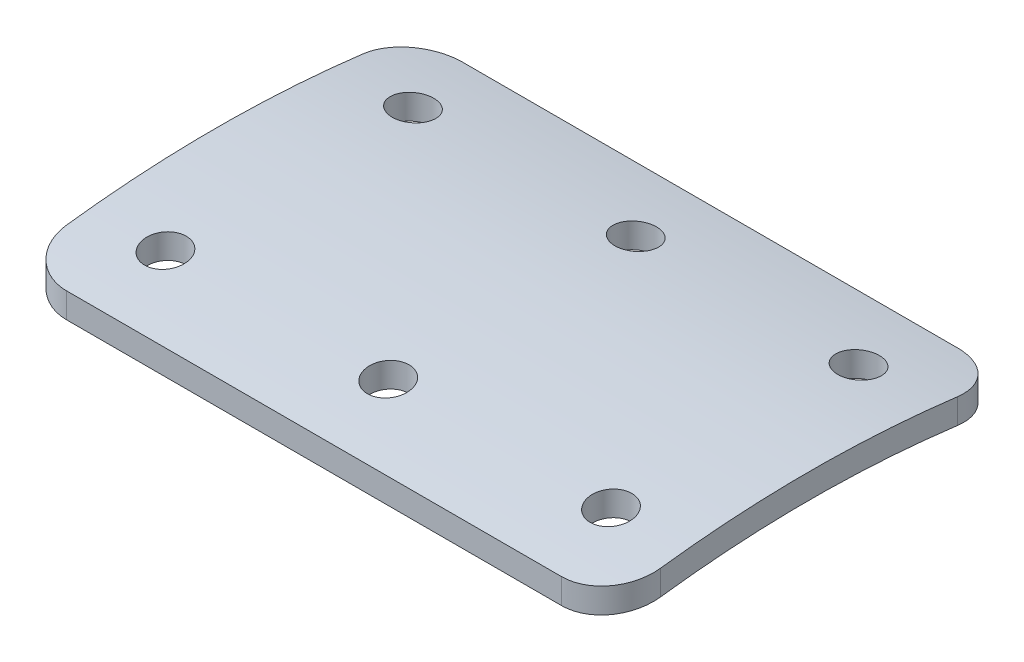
ISO-10303-21;
HEADER;
FILE_DESCRIPTION(('STEP AP214'),'2;1');
FILE_NAME('part.step','',(''),(''),'','','');
FILE_SCHEMA(('AUTOMOTIVE_DESIGN { 1 0 10303 214 1 1 1 1 }'));
ENDSEC;
DATA;
#1=APPLICATION_CONTEXT('core data for automotive mechanical design processes');
#2=APPLICATION_PROTOCOL_DEFINITION('international standard','automotive_design',2000,#1);
#3=PRODUCT_CONTEXT('',#1,'mechanical');
#4=PRODUCT('Part','Part','',(#3));
#5=PRODUCT_RELATED_PRODUCT_CATEGORY('part','',(#4));
#6=PRODUCT_DEFINITION_FORMATION('','',#4);
#7=PRODUCT_DEFINITION_CONTEXT('part definition',#1,'design');
#8=PRODUCT_DEFINITION('design','',#6,#7);
#9=PRODUCT_DEFINITION_SHAPE('','',#8);
#10=(LENGTH_UNIT() NAMED_UNIT(*) SI_UNIT(.MILLI.,.METRE.));
#11=(NAMED_UNIT(*) PLANE_ANGLE_UNIT() SI_UNIT($,.RADIAN.));
#12=(NAMED_UNIT(*) SI_UNIT($,.STERADIAN.) SOLID_ANGLE_UNIT());
#13=UNCERTAINTY_MEASURE_WITH_UNIT(LENGTH_MEASURE(1.E-05),#10,'distance_accuracy_value','');
#14=(GEOMETRIC_REPRESENTATION_CONTEXT(3) GLOBAL_UNCERTAINTY_ASSIGNED_CONTEXT((#13)) GLOBAL_UNIT_ASSIGNED_CONTEXT((#10,
#11,#12)) REPRESENTATION_CONTEXT('',''));
#15=CARTESIAN_POINT('',(0.,0.,0.));
#16=DIRECTION('',(0.,0.,1.));
#17=DIRECTION('',(1.,0.,0.));
#18=AXIS2_PLACEMENT_3D('',#15,#16,#17);
#19=CARTESIAN_POINT('',(0.,0.,0.));
#20=DIRECTION('',(-1.,0.,0.));
#21=DIRECTION('',(0.,-0.999999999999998,0.));
#22=AXIS2_PLACEMENT_3D('',#19,#20,#21);
#23=CYLINDRICAL_SURFACE('',#22,149.225);
#24=CARTESIAN_POINT('',(461.01,148.068547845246,18.5419999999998));
#25=CARTESIAN_POINT('',(460.861020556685,148.068548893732,18.5419932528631));
#26=CARTESIAN_POINT('',(460.711932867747,148.070118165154,18.5294734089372));
#27=CARTESIAN_POINT('',(460.417881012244,148.076335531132,18.4797208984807));
#28=CARTESIAN_POINT('',(460.272922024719,148.080987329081,18.4424585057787));
#29=CARTESIAN_POINT('',(459.991447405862,148.093174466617,18.3443378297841));
#30=CARTESIAN_POINT('',(459.854926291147,148.100707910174,18.2834950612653));
#31=CARTESIAN_POINT('',(459.594100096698,148.118350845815,18.1400101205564));
#32=CARTESIAN_POINT('',(459.469792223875,148.128459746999,18.0573729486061));
#33=CARTESIAN_POINT('',(459.236341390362,148.150900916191,17.8723215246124));
#34=CARTESIAN_POINT('',(459.127258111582,148.163241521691,17.7698330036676));
#35=CARTESIAN_POINT('',(458.927814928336,148.189653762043,17.5482071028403));
#36=CARTESIAN_POINT('',(458.837456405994,148.203725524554,17.4290684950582));
#37=CARTESIAN_POINT('',(458.677361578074,148.233197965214,17.1766086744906));
#38=CARTESIAN_POINT('',(458.607775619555,148.248607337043,17.0431931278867));
#39=CARTESIAN_POINT('',(458.491999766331,148.280138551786,16.766648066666));
#40=CARTESIAN_POINT('',(458.445810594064,148.296260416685,16.6235182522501));
#41=CARTESIAN_POINT('',(458.377922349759,148.328782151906,16.3307928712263));
#42=CARTESIAN_POINT('',(458.356352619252,148.345183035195,16.1811674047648));
#43=CARTESIAN_POINT('',(458.338754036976,148.377682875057,15.8803881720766));
#44=CARTESIAN_POINT('',(458.342725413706,148.393781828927,15.7292343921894));
#45=CARTESIAN_POINT('',(458.376143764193,148.425244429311,15.4295228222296));
#46=CARTESIAN_POINT('',(458.405618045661,148.440607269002,15.2809679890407));
#47=CARTESIAN_POINT('',(458.489287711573,148.470184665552,14.9908692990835));
#48=CARTESIAN_POINT('',(458.543482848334,148.484399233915,14.8493253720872));
#49=CARTESIAN_POINT('',(458.674917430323,148.511311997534,14.5777031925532));
#50=CARTESIAN_POINT('',(458.752092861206,148.52401426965,14.4475943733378));
#51=CARTESIAN_POINT('',(458.927390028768,148.547683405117,14.2021689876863));
#52=CARTESIAN_POINT('',(459.025511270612,148.558650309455,14.0868520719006));
#53=CARTESIAN_POINT('',(459.239434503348,148.578599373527,13.8748601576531));
#54=CARTESIAN_POINT('',(459.355153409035,148.587590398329,13.7781021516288));
#55=CARTESIAN_POINT('',(459.601322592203,148.603504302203,13.6053916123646));
#56=CARTESIAN_POINT('',(459.731772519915,148.610427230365,13.5294385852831));
#57=CARTESIAN_POINT('',(460.003093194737,148.622078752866,13.4008396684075));
#58=CARTESIAN_POINT('',(460.143916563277,148.626816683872,13.3480946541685));
#59=CARTESIAN_POINT('',(460.432469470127,148.634079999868,13.266972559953));
#60=CARTESIAN_POINT('',(460.580198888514,148.636605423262,13.2385950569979));
#61=CARTESIAN_POINT('',(460.877931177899,148.639408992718,13.2070804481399));
#62=CARTESIAN_POINT('',(461.027926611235,148.639693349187,13.203873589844));
#63=CARTESIAN_POINT('',(461.326325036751,148.63802779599,13.2226095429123));
#64=CARTESIAN_POINT('',(461.474728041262,148.636077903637,13.2445521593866));
#65=CARTESIAN_POINT('',(461.765616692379,148.629969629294,13.3129229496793));
#66=CARTESIAN_POINT('',(461.908106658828,148.625812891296,13.3593328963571));
#67=CARTESIAN_POINT('',(462.183256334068,148.615345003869,13.4752819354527));
#68=CARTESIAN_POINT('',(462.315916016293,148.609033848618,13.5448210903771));
#69=CARTESIAN_POINT('',(462.567844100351,148.594335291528,13.7051306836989));
#70=CARTESIAN_POINT('',(462.687093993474,148.585945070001,13.7959299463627));
#71=CARTESIAN_POINT('',(462.908655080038,148.567224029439,13.99609398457));
#72=CARTESIAN_POINT('',(463.010966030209,148.55689318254,14.1054590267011));
#73=CARTESIAN_POINT('',(463.19611687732,148.534435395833,14.3400148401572));
#74=CARTESIAN_POINT('',(463.278891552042,148.522302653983,14.4652565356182));
#75=CARTESIAN_POINT('',(463.42225393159,148.496507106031,14.7277074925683));
#76=CARTESIAN_POINT('',(463.482841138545,148.482844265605,14.8649170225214));
#77=CARTESIAN_POINT('',(463.58040469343,148.454225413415,15.1480660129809));
#78=CARTESIAN_POINT('',(463.617272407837,148.439263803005,15.2940423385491));
#79=CARTESIAN_POINT('',(463.665969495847,148.408469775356,15.5900242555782));
#80=CARTESIAN_POINT('',(463.677798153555,148.392637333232,15.7400299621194));
#81=CARTESIAN_POINT('',(463.676114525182,148.360459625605,16.0404978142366));
#82=CARTESIAN_POINT('',(463.662493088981,148.344112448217,16.1909591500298));
#83=CARTESIAN_POINT('',(463.610090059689,148.311453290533,16.4874406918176));
#84=CARTESIAN_POINT('',(463.571307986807,148.295141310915,16.6334608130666));
#85=CARTESIAN_POINT('',(463.469566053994,148.263041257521,16.917200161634));
#86=CARTESIAN_POINT('',(463.40656057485,148.247254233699,17.0549031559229));
#87=CARTESIAN_POINT('',(463.258127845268,148.216776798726,17.3177720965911));
#88=CARTESIAN_POINT('',(463.172701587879,148.202086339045,17.4429385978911));
#89=CARTESIAN_POINT('',(462.982037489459,148.174368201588,17.676852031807));
#90=CARTESIAN_POINT('',(462.876847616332,148.161336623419,17.7856375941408));
#91=CARTESIAN_POINT('',(462.649436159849,148.13738955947,17.9840054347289));
#92=CARTESIAN_POINT('',(462.527210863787,148.126474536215,18.073583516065));
#93=CARTESIAN_POINT('',(462.269968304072,148.107255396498,18.2304073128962));
#94=CARTESIAN_POINT('',(462.135027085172,148.098936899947,18.2977761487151));
#95=CARTESIAN_POINT('',(461.855714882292,148.08517668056,18.4088085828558));
#96=CARTESIAN_POINT('',(461.711355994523,148.079731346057,18.4525019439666));
#97=CARTESIAN_POINT('',(461.473366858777,148.073416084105,18.5030923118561));
#98=CARTESIAN_POINT('',(461.381322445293,148.071593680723,18.5176636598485));
#99=CARTESIAN_POINT('',(461.196199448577,148.069159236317,18.5371195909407));
#100=CARTESIAN_POINT('',(461.103120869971,148.068547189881,18.542004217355));
#101=CARTESIAN_POINT('',(461.01,148.068547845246,18.5419999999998));
#102=B_SPLINE_CURVE_WITH_KNOTS('',3,(#24,#25,#26,#27,#28,#29,#30,#31,#32,#33,#34,#35,#36,#37,
#38,#39,#40,#41,#42,#43,#44,#45,#46,#47,#48,#49,#50,#51,#52,#53,#54,#55,#56,#57,#58,#59,#60,#61,
#62,#63,#64,#65,#66,#67,#68,#69,#70,#71,#72,#73,#74,#75,#76,#77,#78,#79,#80,#81,#82,#83,#84,#85,
#86,#87,#88,#89,#90,#91,#92,#93,#94,#95,#96,#97,#98,#99,#100,#101),.UNSPECIFIED.,.T.,.F.,(4,2,2,
2,2,2,2,2,2,2,2,2,2,2,2,2,2,2,2,2,2,2,2,2,2,2,2,2,2,2,2,2,2,2,2,2,2,2,4),(0.,0.446596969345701,
0.893731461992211,1.34057225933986,1.78731062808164,2.23575381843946,2.68423009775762,
3.13587774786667,3.58753934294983,4.0415630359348,4.49559079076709,4.9501053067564,
5.40461526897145,5.85787079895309,6.31111562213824,6.76228338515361,7.2134404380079,
7.6626513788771,8.11185452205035,8.55981240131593,9.00776680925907,9.45538798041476,
9.90301036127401,10.351243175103,10.7994824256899,11.2491976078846,11.6989228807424,
12.1506934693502,12.6024769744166,13.0562025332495,13.5099367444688,13.964529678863,
14.4191024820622,14.8725859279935,15.3261683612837,15.7771922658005,16.2276478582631,
16.5067983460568,16.7859475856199),.UNSPECIFIED.);
#103=CARTESIAN_POINT('',(461.01,148.068547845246,18.5419999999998));
#104=VERTEX_POINT('',#103);
#105=EDGE_CURVE('E231',#104,#104,#102,.T.);
#106=ORIENTED_EDGE('',*,*,#105,.F.);
#107=EDGE_LOOP('',(#106));
#108=FACE_BOUND('',#107,.T.);
#109=CARTESIAN_POINT('',(489.585,148.068547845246,18.5419999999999));
#110=CARTESIAN_POINT('',(489.436020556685,148.068548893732,18.5419932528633));
#111=CARTESIAN_POINT('',(489.286932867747,148.070118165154,18.5294734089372));
#112=CARTESIAN_POINT('',(488.992881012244,148.076335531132,18.4797208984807));
#113=CARTESIAN_POINT('',(488.847922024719,148.080987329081,18.4424585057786));
#114=CARTESIAN_POINT('',(488.566447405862,148.093174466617,18.3443378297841));
#115=CARTESIAN_POINT('',(488.429926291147,148.100707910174,18.2834950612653));
#116=CARTESIAN_POINT('',(488.169100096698,148.118350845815,18.1400101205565));
#117=CARTESIAN_POINT('',(488.044792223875,148.128459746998,18.0573729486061));
#118=CARTESIAN_POINT('',(487.811341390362,148.150900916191,17.8723215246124));
#119=CARTESIAN_POINT('',(487.702258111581,148.163241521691,17.7698330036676));
#120=CARTESIAN_POINT('',(487.502814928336,148.189653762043,17.5482071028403));
#121=CARTESIAN_POINT('',(487.412456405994,148.203725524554,17.4290684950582));
#122=CARTESIAN_POINT('',(487.252361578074,148.233197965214,17.1766086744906));
#123=CARTESIAN_POINT('',(487.182775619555,148.248607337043,17.0431931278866));
#124=CARTESIAN_POINT('',(487.066999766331,148.280138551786,16.7666480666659));
#125=CARTESIAN_POINT('',(487.020810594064,148.296260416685,16.62351825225));
#126=CARTESIAN_POINT('',(486.952922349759,148.328782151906,16.3307928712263));
#127=CARTESIAN_POINT('',(486.931352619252,148.345183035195,16.1811674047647));
#128=CARTESIAN_POINT('',(486.913754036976,148.377682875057,15.8803881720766));
#129=CARTESIAN_POINT('',(486.917725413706,148.393781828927,15.7292343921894));
#130=CARTESIAN_POINT('',(486.951143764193,148.425244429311,15.4295228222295));
#131=CARTESIAN_POINT('',(486.98061804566,148.440607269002,15.2809679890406));
#132=CARTESIAN_POINT('',(487.064287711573,148.470184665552,14.9908692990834));
#133=CARTESIAN_POINT('',(487.118482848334,148.484399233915,14.8493253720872));
#134=CARTESIAN_POINT('',(487.249917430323,148.511311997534,14.5777031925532));
#135=CARTESIAN_POINT('',(487.327092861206,148.52401426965,14.4475943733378));
#136=CARTESIAN_POINT('',(487.502390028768,148.547683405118,14.2021689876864));
#137=CARTESIAN_POINT('',(487.600511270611,148.558650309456,14.0868520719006));
#138=CARTESIAN_POINT('',(487.814434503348,148.578599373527,13.8748601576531));
#139=CARTESIAN_POINT('',(487.930153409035,148.587590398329,13.7781021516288));
#140=CARTESIAN_POINT('',(488.176322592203,148.603504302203,13.6053916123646));
#141=CARTESIAN_POINT('',(488.306772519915,148.610427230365,13.5294385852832));
#142=CARTESIAN_POINT('',(488.578093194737,148.622078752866,13.4008396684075));
#143=CARTESIAN_POINT('',(488.718916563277,148.626816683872,13.3480946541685));
#144=CARTESIAN_POINT('',(489.007469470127,148.634079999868,13.266972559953));
#145=CARTESIAN_POINT('',(489.155198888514,148.636605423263,13.2385950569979));
#146=CARTESIAN_POINT('',(489.452931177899,148.639408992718,13.2070804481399));
#147=CARTESIAN_POINT('',(489.602926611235,148.639693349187,13.203873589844));
#148=CARTESIAN_POINT('',(489.901325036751,148.63802779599,13.2226095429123));
#149=CARTESIAN_POINT('',(490.049728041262,148.636077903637,13.2445521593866));
#150=CARTESIAN_POINT('',(490.340616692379,148.629969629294,13.3129229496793));
#151=CARTESIAN_POINT('',(490.483106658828,148.625812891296,13.3593328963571));
#152=CARTESIAN_POINT('',(490.758256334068,148.615345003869,13.4752819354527));
#153=CARTESIAN_POINT('',(490.890916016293,148.609033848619,13.5448210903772));
#154=CARTESIAN_POINT('',(491.142844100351,148.594335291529,13.705130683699));
#155=CARTESIAN_POINT('',(491.262093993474,148.585945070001,13.7959299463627));
#156=CARTESIAN_POINT('',(491.483655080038,148.567224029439,13.99609398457));
#157=CARTESIAN_POINT('',(491.585966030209,148.55689318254,14.1054590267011));
#158=CARTESIAN_POINT('',(491.77111687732,148.534435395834,14.3400148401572));
#159=CARTESIAN_POINT('',(491.853891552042,148.522302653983,14.4652565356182));
#160=CARTESIAN_POINT('',(491.99725393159,148.496507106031,14.7277074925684));
#161=CARTESIAN_POINT('',(492.057841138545,148.482844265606,14.8649170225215));
#162=CARTESIAN_POINT('',(492.15540469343,148.454225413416,15.148066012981));
#163=CARTESIAN_POINT('',(492.192272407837,148.439263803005,15.2940423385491));
#164=CARTESIAN_POINT('',(492.240969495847,148.408469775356,15.5900242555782));
#165=CARTESIAN_POINT('',(492.252798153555,148.392637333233,15.7400299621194));
#166=CARTESIAN_POINT('',(492.251114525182,148.360459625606,16.0404978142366));
#167=CARTESIAN_POINT('',(492.237493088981,148.344112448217,16.1909591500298));
#168=CARTESIAN_POINT('',(492.185090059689,148.311453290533,16.4874406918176));
#169=CARTESIAN_POINT('',(492.146307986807,148.295141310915,16.6334608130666));
#170=CARTESIAN_POINT('',(492.044566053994,148.263041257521,16.917200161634));
#171=CARTESIAN_POINT('',(491.98156057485,148.247254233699,17.0549031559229));
#172=CARTESIAN_POINT('',(491.833127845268,148.216776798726,17.3177720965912));
#173=CARTESIAN_POINT('',(491.747701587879,148.202086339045,17.4429385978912));
#174=CARTESIAN_POINT('',(491.557037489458,148.174368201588,17.676852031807));
#175=CARTESIAN_POINT('',(491.451847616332,148.161336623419,17.7856375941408));
#176=CARTESIAN_POINT('',(491.224436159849,148.13738955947,17.9840054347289));
#177=CARTESIAN_POINT('',(491.102210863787,148.126474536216,18.073583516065));
#178=CARTESIAN_POINT('',(490.844968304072,148.107255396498,18.2304073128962));
#179=CARTESIAN_POINT('',(490.710027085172,148.098936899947,18.2977761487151));
#180=CARTESIAN_POINT('',(490.430714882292,148.08517668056,18.4088085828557));
#181=CARTESIAN_POINT('',(490.286355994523,148.079731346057,18.4525019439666));
#182=CARTESIAN_POINT('',(490.048366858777,148.073416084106,18.5030923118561));
#183=CARTESIAN_POINT('',(489.956322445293,148.071593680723,18.5176636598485));
#184=CARTESIAN_POINT('',(489.771199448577,148.069159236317,18.5371195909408));
#185=CARTESIAN_POINT('',(489.678120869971,148.068547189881,18.5420042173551));
#186=CARTESIAN_POINT('',(489.585,148.068547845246,18.5419999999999));
#187=B_SPLINE_CURVE_WITH_KNOTS('',3,(#109,#110,#111,#112,#113,#114,#115,#116,#117,#118,#119,
#120,#121,#122,#123,#124,#125,#126,#127,#128,#129,#130,#131,#132,#133,#134,#135,#136,#137,#138,
#139,#140,#141,#142,#143,#144,#145,#146,#147,#148,#149,#150,#151,#152,#153,#154,#155,#156,#157,
#158,#159,#160,#161,#162,#163,#164,#165,#166,#167,#168,#169,#170,#171,#172,#173,#174,#175,#176,
#177,#178,#179,#180,#181,#182,#183,#184,#185,#186),.UNSPECIFIED.,.T.,.F.,(4,2,2,2,2,2,2,2,2,2,2,
2,2,2,2,2,2,2,2,2,2,2,2,2,2,2,2,2,2,2,2,2,2,2,2,2,2,2,4),(0.,0.446596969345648,
0.893731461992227,1.3405722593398,1.78731062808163,2.23575381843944,2.68423009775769,
3.13587774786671,3.58753934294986,4.04156303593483,4.49559079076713,4.95010530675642,
5.40461526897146,5.85787079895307,6.31111562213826,6.76228338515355,7.21344043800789,
7.66265137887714,8.11185452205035,8.55981240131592,9.00776680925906,9.4553879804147,
9.903010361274,10.351243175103,10.7994824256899,11.2491976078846,11.6989228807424,
12.1506934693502,12.6024769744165,13.0562025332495,13.5099367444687,13.9645296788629,
14.4191024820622,14.8725859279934,15.3261683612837,15.7771922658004,16.2276478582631,
16.5067983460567,16.7859475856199),.UNSPECIFIED.);
#188=CARTESIAN_POINT('',(489.585,148.068547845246,18.5419999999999));
#189=VERTEX_POINT('',#188);
#190=EDGE_CURVE('E224',#189,#189,#187,.T.);
#191=ORIENTED_EDGE('',*,*,#190,.F.);
#192=EDGE_LOOP('',(#191));
#193=FACE_BOUND('',#192,.T.);
#194=CARTESIAN_POINT('',(489.585,148.639326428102,-13.2080000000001));
#195=CARTESIAN_POINT('',(489.435654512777,148.639326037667,-13.2080066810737));
#196=CARTESIAN_POINT('',(489.28620083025,148.638209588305,-13.2205873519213));
#197=CARTESIAN_POINT('',(488.991416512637,148.633753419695,-13.2705906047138));
#198=CARTESIAN_POINT('',(488.8460910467,148.630411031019,-13.3080430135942));
#199=CARTESIAN_POINT('',(488.56388318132,148.621544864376,-13.4066947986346));
#200=CARTESIAN_POINT('',(488.426996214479,148.616022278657,-13.4678811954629));
#201=CARTESIAN_POINT('',(488.165497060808,148.60287175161,-13.6122135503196));
#202=CARTESIAN_POINT('',(488.040881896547,148.595244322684,-13.695354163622));
#203=CARTESIAN_POINT('',(487.807188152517,148.577983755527,-13.881357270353));
#204=CARTESIAN_POINT('',(487.69813505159,148.568347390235,-13.9842514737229));
#205=CARTESIAN_POINT('',(487.498842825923,148.547238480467,-14.2067246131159));
#206=CARTESIAN_POINT('',(487.408604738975,148.535765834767,-14.3263044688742));
#207=CARTESIAN_POINT('',(487.249134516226,148.51115527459,-14.5792167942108));
#208=CARTESIAN_POINT('',(487.179982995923,148.498011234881,-14.7125994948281));
#209=CARTESIAN_POINT('',(487.06504115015,148.470372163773,-14.988945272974));
#210=CARTESIAN_POINT('',(487.019251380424,148.455877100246,-15.1319085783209));
#211=CARTESIAN_POINT('',(486.952108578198,148.42580801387,-15.4240653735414));
#212=CARTESIAN_POINT('',(486.930870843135,148.410229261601,-15.5732848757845));
#213=CARTESIAN_POINT('',(486.913776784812,148.378461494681,-15.8731066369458));
#214=CARTESIAN_POINT('',(486.917921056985,148.362272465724,-16.0237089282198));
#215=CARTESIAN_POINT('',(486.951518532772,148.329684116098,-16.322626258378));
#216=CARTESIAN_POINT('',(486.981067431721,148.31328423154,-16.4709304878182));
#217=CARTESIAN_POINT('',(487.064772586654,148.28084362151,-16.7604676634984));
#218=CARTESIAN_POINT('',(487.118929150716,148.264802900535,-16.9017005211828));
#219=CARTESIAN_POINT('',(487.250393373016,148.233603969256,-17.1731762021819));
#220=CARTESIAN_POINT('',(487.327716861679,148.218446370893,-17.3034114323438));
#221=CARTESIAN_POINT('',(487.503352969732,148.189564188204,-17.5490458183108));
#222=CARTESIAN_POINT('',(487.601665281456,148.175839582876,-17.6644451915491));
#223=CARTESIAN_POINT('',(487.816130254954,148.150386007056,-17.8766651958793));
#224=CARTESIAN_POINT('',(487.932216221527,148.138649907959,-17.9735523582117));
#225=CARTESIAN_POINT('',(488.179220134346,148.117572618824,-18.1464298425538));
#226=CARTESIAN_POINT('',(488.310137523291,148.108231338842,-18.2224209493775));
#227=CARTESIAN_POINT('',(488.582136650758,148.092378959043,-18.3508064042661));
#228=CARTESIAN_POINT('',(488.723143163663,148.085849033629,-18.4033577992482));
#229=CARTESIAN_POINT('',(489.012077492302,148.075798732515,-18.4840505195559));
#230=CARTESIAN_POINT('',(489.160005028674,148.072278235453,-18.5121928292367));
#231=CARTESIAN_POINT('',(489.45758302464,148.068407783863,-18.5431250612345));
#232=CARTESIAN_POINT('',(489.607216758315,148.06803799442,-18.5460735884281));
#233=CARTESIAN_POINT('',(489.904848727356,148.070432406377,-18.5269469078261));
#234=CARTESIAN_POINT('',(490.052846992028,148.073196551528,-18.5048721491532));
#235=CARTESIAN_POINT('',(490.342711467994,148.0817343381,-18.4364246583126));
#236=CARTESIAN_POINT('',(490.484589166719,148.087502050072,-18.3900997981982));
#237=CARTESIAN_POINT('',(490.758534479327,148.101806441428,-18.2745430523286));
#238=CARTESIAN_POINT('',(490.89060195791,148.110343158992,-18.2053108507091));
#239=CARTESIAN_POINT('',(491.1417054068,148.129879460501,-18.0456615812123));
#240=CARTESIAN_POINT('',(491.260693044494,148.140887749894,-17.9551695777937));
#241=CARTESIAN_POINT('',(491.481808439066,148.164923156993,-17.7557380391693));
#242=CARTESIAN_POINT('',(491.583935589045,148.177950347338,-17.6467978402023));
#243=CARTESIAN_POINT('',(491.769179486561,148.205636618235,-17.4127497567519));
#244=CARTESIAN_POINT('',(491.852160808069,148.220306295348,-17.2875359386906));
#245=CARTESIAN_POINT('',(491.995935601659,148.250682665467,-17.0250740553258));
#246=CARTESIAN_POINT('',(492.056728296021,148.2663893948,-16.8878255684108));
#247=CARTESIAN_POINT('',(492.154766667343,148.298413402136,-16.604266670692));
#248=CARTESIAN_POINT('',(492.191864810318,148.314733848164,-16.4579055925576));
#249=CARTESIAN_POINT('',(492.240883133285,148.347376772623,-16.1610248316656));
#250=CARTESIAN_POINT('',(492.252802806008,148.363699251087,-16.0105050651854));
#251=CARTESIAN_POINT('',(492.251111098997,148.395906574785,-15.7091867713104));
#252=CARTESIAN_POINT('',(492.237437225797,148.411790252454,-15.5583884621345));
#253=CARTESIAN_POINT('',(492.184786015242,148.442646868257,-15.2611777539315));
#254=CARTESIAN_POINT('',(492.145808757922,148.457619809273,-15.1147653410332));
#255=CARTESIAN_POINT('',(492.043699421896,148.486259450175,-14.8307697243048));
#256=CARTESIAN_POINT('',(491.98060899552,148.499928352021,-14.6931717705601));
#257=CARTESIAN_POINT('',(491.832016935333,148.525683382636,-14.4305037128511));
#258=CARTESIAN_POINT('',(491.7465166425,148.537769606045,-14.3054328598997));
#259=CARTESIAN_POINT('',(491.555926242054,148.56006952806,-14.0719609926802));
#260=CARTESIAN_POINT('',(491.450923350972,148.570291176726,-13.9634895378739));
#261=CARTESIAN_POINT('',(491.224011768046,148.588748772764,-13.7656914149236));
#262=CARTESIAN_POINT('',(491.102099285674,148.596984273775,-13.6763690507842));
#263=CARTESIAN_POINT('',(490.845410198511,148.611307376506,-13.5198416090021));
#264=CARTESIAN_POINT('',(490.710688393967,148.617403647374,-13.4525473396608));
#265=CARTESIAN_POINT('',(490.431892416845,148.62740488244,-13.3415994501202));
#266=CARTESIAN_POINT('',(490.287829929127,148.631312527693,-13.2979169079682));
#267=CARTESIAN_POINT('',(490.049862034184,148.635842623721,-13.247160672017));
#268=CARTESIAN_POINT('',(489.957519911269,148.637148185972,-13.2324941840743));
#269=CARTESIAN_POINT('',(489.771799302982,148.638890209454,-13.2129117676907));
#270=CARTESIAN_POINT('',(489.678420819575,148.639326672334,-13.2079958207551));
#271=CARTESIAN_POINT('',(489.585,148.639326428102,-13.2080000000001));
#272=B_SPLINE_CURVE_WITH_KNOTS('',3,(#194,#195,#196,#197,#198,#199,#200,#201,#202,#203,#204,
#205,#206,#207,#208,#209,#210,#211,#212,#213,#214,#215,#216,#217,#218,#219,#220,#221,#222,#223,
#224,#225,#226,#227,#228,#229,#230,#231,#232,#233,#234,#235,#236,#237,#238,#239,#240,#241,#242,
#243,#244,#245,#246,#247,#248,#249,#250,#251,#252,#253,#254,#255,#256,#257,#258,#259,#260,#261,
#262,#263,#264,#265,#266,#267,#268,#269,#270,#271),.UNSPECIFIED.,.T.,.F.,(4,2,2,2,2,2,2,2,2,2,2,
2,2,2,2,2,2,2,2,2,2,2,2,2,2,2,2,2,2,2,2,2,2,2,2,2,2,2,4),(0.,0.447694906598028,
0.895927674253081,1.34391566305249,1.79179469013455,2.24039879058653,2.68902762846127,
3.13935070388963,3.58968449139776,4.04212458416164,4.49457529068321,4.94873781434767,
5.40290602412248,5.85738528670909,6.31185788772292,6.76466509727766,7.21745529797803,
7.66716446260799,8.11685549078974,8.56371343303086,9.01056335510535,9.45653446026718,
9.90251171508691,10.3500851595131,10.7976747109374,11.2483393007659,11.6990196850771,
12.1524795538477,12.6059485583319,13.0605262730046,13.5151025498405,13.9688971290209,
14.4226645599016,14.8744495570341,15.326335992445,15.7763694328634,16.2258503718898,
16.5058997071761,16.785948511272),.UNSPECIFIED.);
#273=CARTESIAN_POINT('',(489.585,148.639326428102,-13.2080000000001));
#274=VERTEX_POINT('',#273);
#275=EDGE_CURVE('E217',#274,#274,#272,.T.);
#276=ORIENTED_EDGE('',*,*,#275,.F.);
#277=EDGE_LOOP('',(#276));
#278=FACE_BOUND('',#277,.T.);
#279=CARTESIAN_POINT('',(461.01,148.639326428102,-13.2080000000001));
#280=CARTESIAN_POINT('',(460.860654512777,148.639326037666,-13.2080066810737));
#281=CARTESIAN_POINT('',(460.71120083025,148.638209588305,-13.2205873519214));
#282=CARTESIAN_POINT('',(460.416416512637,148.633753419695,-13.2705906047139));
#283=CARTESIAN_POINT('',(460.2710910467,148.630411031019,-13.3080430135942));
#284=CARTESIAN_POINT('',(459.98888318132,148.621544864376,-13.4066947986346));
#285=CARTESIAN_POINT('',(459.851996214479,148.616022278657,-13.467881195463));
#286=CARTESIAN_POINT('',(459.590497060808,148.60287175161,-13.6122135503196));
#287=CARTESIAN_POINT('',(459.465881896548,148.595244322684,-13.695354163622));
#288=CARTESIAN_POINT('',(459.232188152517,148.577983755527,-13.881357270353));
#289=CARTESIAN_POINT('',(459.12313505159,148.568347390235,-13.9842514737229));
#290=CARTESIAN_POINT('',(458.923842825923,148.547238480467,-14.206724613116));
#291=CARTESIAN_POINT('',(458.833604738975,148.535765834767,-14.3263044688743));
#292=CARTESIAN_POINT('',(458.674134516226,148.51115527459,-14.5792167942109));
#293=CARTESIAN_POINT('',(458.604982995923,148.49801123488,-14.7125994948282));
#294=CARTESIAN_POINT('',(458.49004115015,148.470372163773,-14.9889452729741));
#295=CARTESIAN_POINT('',(458.444251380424,148.455877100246,-15.1319085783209));
#296=CARTESIAN_POINT('',(458.377108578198,148.42580801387,-15.4240653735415));
#297=CARTESIAN_POINT('',(458.355870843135,148.410229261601,-15.5732848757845));
#298=CARTESIAN_POINT('',(458.338776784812,148.378461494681,-15.8731066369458));
#299=CARTESIAN_POINT('',(458.342921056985,148.362272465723,-16.0237089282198));
#300=CARTESIAN_POINT('',(458.376518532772,148.329684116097,-16.3226262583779));
#301=CARTESIAN_POINT('',(458.406067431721,148.31328423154,-16.4709304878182));
#302=CARTESIAN_POINT('',(458.489772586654,148.28084362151,-16.7604676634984));
#303=CARTESIAN_POINT('',(458.543929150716,148.264802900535,-16.9017005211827));
#304=CARTESIAN_POINT('',(458.675393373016,148.233603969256,-17.1731762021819));
#305=CARTESIAN_POINT('',(458.752716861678,148.218446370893,-17.3034114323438));
#306=CARTESIAN_POINT('',(458.928352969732,148.189564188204,-17.5490458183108));
#307=CARTESIAN_POINT('',(459.026665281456,148.175839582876,-17.6644451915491));
#308=CARTESIAN_POINT('',(459.241130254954,148.150386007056,-17.8766651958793));
#309=CARTESIAN_POINT('',(459.357216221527,148.138649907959,-17.9735523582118));
#310=CARTESIAN_POINT('',(459.604220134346,148.117572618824,-18.1464298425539));
#311=CARTESIAN_POINT('',(459.735137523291,148.108231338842,-18.2224209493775));
#312=CARTESIAN_POINT('',(460.007136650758,148.092378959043,-18.3508064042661));
#313=CARTESIAN_POINT('',(460.148143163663,148.085849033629,-18.4033577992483));
#314=CARTESIAN_POINT('',(460.437077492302,148.075798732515,-18.4840505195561));
#315=CARTESIAN_POINT('',(460.585005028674,148.072278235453,-18.5121928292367));
#316=CARTESIAN_POINT('',(460.88258302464,148.068407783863,-18.5431250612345));
#317=CARTESIAN_POINT('',(461.032216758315,148.06803799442,-18.5460735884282));
#318=CARTESIAN_POINT('',(461.329848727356,148.070432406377,-18.5269469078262));
#319=CARTESIAN_POINT('',(461.477846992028,148.073196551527,-18.5048721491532));
#320=CARTESIAN_POINT('',(461.767711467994,148.081734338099,-18.4364246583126));
#321=CARTESIAN_POINT('',(461.909589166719,148.087502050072,-18.3900997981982));
#322=CARTESIAN_POINT('',(462.183534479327,148.101806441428,-18.2745430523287));
#323=CARTESIAN_POINT('',(462.31560195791,148.110343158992,-18.2053108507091));
#324=CARTESIAN_POINT('',(462.5667054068,148.1298794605,-18.0456615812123));
#325=CARTESIAN_POINT('',(462.685693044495,148.140887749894,-17.9551695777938));
#326=CARTESIAN_POINT('',(462.906808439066,148.164923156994,-17.7557380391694));
#327=CARTESIAN_POINT('',(463.008935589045,148.177950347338,-17.6467978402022));
#328=CARTESIAN_POINT('',(463.194179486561,148.205636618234,-17.4127497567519));
#329=CARTESIAN_POINT('',(463.277160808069,148.220306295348,-17.2875359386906));
#330=CARTESIAN_POINT('',(463.420935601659,148.250682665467,-17.0250740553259));
#331=CARTESIAN_POINT('',(463.481728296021,148.266389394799,-16.8878255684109));
#332=CARTESIAN_POINT('',(463.579766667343,148.298413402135,-16.6042666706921));
#333=CARTESIAN_POINT('',(463.616864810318,148.314733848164,-16.4579055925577));
#334=CARTESIAN_POINT('',(463.665883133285,148.347376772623,-16.1610248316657));
#335=CARTESIAN_POINT('',(463.677802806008,148.363699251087,-16.0105050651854));
#336=CARTESIAN_POINT('',(463.676111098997,148.395906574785,-15.7091867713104));
#337=CARTESIAN_POINT('',(463.662437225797,148.411790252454,-15.5583884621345));
#338=CARTESIAN_POINT('',(463.609786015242,148.442646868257,-15.2611777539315));
#339=CARTESIAN_POINT('',(463.570808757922,148.457619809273,-15.1147653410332));
#340=CARTESIAN_POINT('',(463.468699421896,148.486259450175,-14.8307697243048));
#341=CARTESIAN_POINT('',(463.40560899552,148.499928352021,-14.6931717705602));
#342=CARTESIAN_POINT('',(463.257016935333,148.525683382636,-14.4305037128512));
#343=CARTESIAN_POINT('',(463.1715166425,148.537769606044,-14.3054328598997));
#344=CARTESIAN_POINT('',(462.980926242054,148.560069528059,-14.0719609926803));
#345=CARTESIAN_POINT('',(462.875923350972,148.570291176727,-13.963489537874));
#346=CARTESIAN_POINT('',(462.649011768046,148.588748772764,-13.7656914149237));
#347=CARTESIAN_POINT('',(462.527099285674,148.596984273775,-13.6763690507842));
#348=CARTESIAN_POINT('',(462.270410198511,148.611307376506,-13.5198416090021));
#349=CARTESIAN_POINT('',(462.135688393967,148.617403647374,-13.4525473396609));
#350=CARTESIAN_POINT('',(461.856892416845,148.62740488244,-13.3415994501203));
#351=CARTESIAN_POINT('',(461.712829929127,148.631312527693,-13.2979169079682));
#352=CARTESIAN_POINT('',(461.474862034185,148.635842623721,-13.2471606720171));
#353=CARTESIAN_POINT('',(461.382519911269,148.637148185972,-13.2324941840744));
#354=CARTESIAN_POINT('',(461.196799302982,148.638890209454,-13.2129117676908));
#355=CARTESIAN_POINT('',(461.103420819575,148.639326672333,-13.2079958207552));
#356=CARTESIAN_POINT('',(461.01,148.639326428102,-13.2080000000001));
#357=B_SPLINE_CURVE_WITH_KNOTS('',3,(#279,#280,#281,#282,#283,#284,#285,#286,#287,#288,#289,
#290,#291,#292,#293,#294,#295,#296,#297,#298,#299,#300,#301,#302,#303,#304,#305,#306,#307,#308,
#309,#310,#311,#312,#313,#314,#315,#316,#317,#318,#319,#320,#321,#322,#323,#324,#325,#326,#327,
#328,#329,#330,#331,#332,#333,#334,#335,#336,#337,#338,#339,#340,#341,#342,#343,#344,#345,#346,
#347,#348,#349,#350,#351,#352,#353,#354,#355,#356),.UNSPECIFIED.,.T.,.F.,(4,2,2,2,2,2,2,2,2,2,2,
2,2,2,2,2,2,2,2,2,2,2,2,2,2,2,2,2,2,2,2,2,2,2,2,2,2,2,4),(0.,0.447694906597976,
0.895927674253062,1.34391566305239,1.79179469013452,2.24039879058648,2.68902762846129,
3.13935070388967,3.58968449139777,4.04212458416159,4.49457529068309,4.94873781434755,
5.4029060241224,5.85738528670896,6.31185788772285,6.76466509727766,7.21745529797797,
7.6671644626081,8.11685549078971,8.56371343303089,9.01056335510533,9.45653446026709,
9.90251171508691,10.3500851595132,10.7976747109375,11.2483393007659,11.699019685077,
12.1524795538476,12.6059485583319,13.0605262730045,13.5151025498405,13.968897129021,
14.4226645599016,14.8744495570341,15.326335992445,15.7763694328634,16.2258503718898,
16.505899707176,16.785948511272),.UNSPECIFIED.);
#358=CARTESIAN_POINT('',(461.01,148.639326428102,-13.2080000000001));
#359=VERTEX_POINT('',#358);
#360=EDGE_CURVE('E211',#359,#359,#357,.T.);
#361=ORIENTED_EDGE('',*,*,#360,.F.);
#362=EDGE_LOOP('',(#361));
#363=FACE_BOUND('',#362,.T.);
#364=CARTESIAN_POINT('',(432.435,148.639326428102,-13.2080000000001));
#365=CARTESIAN_POINT('',(432.285654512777,148.639326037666,-13.2080066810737));
#366=CARTESIAN_POINT('',(432.13620083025,148.638209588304,-13.2205873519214));
#367=CARTESIAN_POINT('',(431.841416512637,148.633753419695,-13.2705906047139));
#368=CARTESIAN_POINT('',(431.6960910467,148.630411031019,-13.308043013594));
#369=CARTESIAN_POINT('',(431.41388318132,148.621544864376,-13.4066947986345));
#370=CARTESIAN_POINT('',(431.276996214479,148.616022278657,-13.4678811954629));
#371=CARTESIAN_POINT('',(431.015497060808,148.60287175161,-13.6122135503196));
#372=CARTESIAN_POINT('',(430.890881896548,148.595244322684,-13.6953541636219));
#373=CARTESIAN_POINT('',(430.657188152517,148.577983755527,-13.8813572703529));
#374=CARTESIAN_POINT('',(430.54813505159,148.568347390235,-13.9842514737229));
#375=CARTESIAN_POINT('',(430.348842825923,148.547238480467,-14.206724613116));
#376=CARTESIAN_POINT('',(430.258604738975,148.535765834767,-14.3263044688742));
#377=CARTESIAN_POINT('',(430.099134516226,148.51115527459,-14.5792167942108));
#378=CARTESIAN_POINT('',(430.029982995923,148.498011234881,-14.7125994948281));
#379=CARTESIAN_POINT('',(429.91504115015,148.470372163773,-14.988945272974));
#380=CARTESIAN_POINT('',(429.869251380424,148.455877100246,-15.1319085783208));
#381=CARTESIAN_POINT('',(429.802108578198,148.42580801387,-15.4240653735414));
#382=CARTESIAN_POINT('',(429.780870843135,148.410229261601,-15.5732848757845));
#383=CARTESIAN_POINT('',(429.763776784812,148.378461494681,-15.8731066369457));
#384=CARTESIAN_POINT('',(429.767921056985,148.362272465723,-16.0237089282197));
#385=CARTESIAN_POINT('',(429.801518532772,148.329684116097,-16.3226262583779));
#386=CARTESIAN_POINT('',(429.831067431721,148.31328423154,-16.4709304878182));
#387=CARTESIAN_POINT('',(429.914772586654,148.28084362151,-16.7604676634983));
#388=CARTESIAN_POINT('',(429.968929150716,148.264802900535,-16.9017005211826));
#389=CARTESIAN_POINT('',(430.100393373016,148.233603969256,-17.1731762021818));
#390=CARTESIAN_POINT('',(430.177716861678,148.218446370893,-17.3034114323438));
#391=CARTESIAN_POINT('',(430.353352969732,148.189564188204,-17.5490458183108));
#392=CARTESIAN_POINT('',(430.451665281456,148.175839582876,-17.664445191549));
#393=CARTESIAN_POINT('',(430.666130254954,148.150386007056,-17.8766651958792));
#394=CARTESIAN_POINT('',(430.782216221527,148.138649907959,-17.9735523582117));
#395=CARTESIAN_POINT('',(431.029220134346,148.117572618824,-18.1464298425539));
#396=CARTESIAN_POINT('',(431.160137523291,148.108231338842,-18.2224209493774));
#397=CARTESIAN_POINT('',(431.432136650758,148.092378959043,-18.350806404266));
#398=CARTESIAN_POINT('',(431.573143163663,148.085849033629,-18.4033577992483));
#399=CARTESIAN_POINT('',(431.862077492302,148.075798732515,-18.4840505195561));
#400=CARTESIAN_POINT('',(432.010005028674,148.072278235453,-18.5121928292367));
#401=CARTESIAN_POINT('',(432.30758302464,148.068407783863,-18.5431250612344));
#402=CARTESIAN_POINT('',(432.457216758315,148.06803799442,-18.5460735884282));
#403=CARTESIAN_POINT('',(432.754848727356,148.070432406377,-18.5269469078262));
#404=CARTESIAN_POINT('',(432.902846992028,148.073196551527,-18.5048721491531));
#405=CARTESIAN_POINT('',(433.192711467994,148.081734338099,-18.4364246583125));
#406=CARTESIAN_POINT('',(433.334589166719,148.087502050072,-18.3900997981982));
#407=CARTESIAN_POINT('',(433.608534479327,148.101806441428,-18.2745430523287));
#408=CARTESIAN_POINT('',(433.74060195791,148.110343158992,-18.205310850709));
#409=CARTESIAN_POINT('',(433.9917054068,148.1298794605,-18.0456615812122));
#410=CARTESIAN_POINT('',(434.110693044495,148.140887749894,-17.9551695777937));
#411=CARTESIAN_POINT('',(434.331808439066,148.164923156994,-17.7557380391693));
#412=CARTESIAN_POINT('',(434.433935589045,148.177950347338,-17.6467978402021));
#413=CARTESIAN_POINT('',(434.619179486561,148.205636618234,-17.4127497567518));
#414=CARTESIAN_POINT('',(434.702160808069,148.220306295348,-17.2875359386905));
#415=CARTESIAN_POINT('',(434.84593560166,148.250682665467,-17.0250740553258));
#416=CARTESIAN_POINT('',(434.906728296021,148.266389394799,-16.8878255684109));
#417=CARTESIAN_POINT('',(435.004766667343,148.298413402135,-16.604266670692));
#418=CARTESIAN_POINT('',(435.041864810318,148.314733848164,-16.4579055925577));
#419=CARTESIAN_POINT('',(435.090883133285,148.347376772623,-16.1610248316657));
#420=CARTESIAN_POINT('',(435.102802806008,148.363699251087,-16.0105050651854));
#421=CARTESIAN_POINT('',(435.101111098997,148.395906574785,-15.7091867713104));
#422=CARTESIAN_POINT('',(435.087437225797,148.411790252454,-15.5583884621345));
#423=CARTESIAN_POINT('',(435.034786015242,148.442646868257,-15.2611777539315));
#424=CARTESIAN_POINT('',(434.995808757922,148.457619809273,-15.1147653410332));
#425=CARTESIAN_POINT('',(434.893699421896,148.486259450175,-14.8307697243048));
#426=CARTESIAN_POINT('',(434.83060899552,148.499928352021,-14.6931717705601));
#427=CARTESIAN_POINT('',(434.682016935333,148.525683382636,-14.4305037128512));
#428=CARTESIAN_POINT('',(434.5965166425,148.537769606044,-14.3054328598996));
#429=CARTESIAN_POINT('',(434.405926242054,148.560069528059,-14.0719609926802));
#430=CARTESIAN_POINT('',(434.300923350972,148.570291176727,-13.963489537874));
#431=CARTESIAN_POINT('',(434.074011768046,148.588748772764,-13.7656914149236));
#432=CARTESIAN_POINT('',(433.952099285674,148.596984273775,-13.6763690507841));
#433=CARTESIAN_POINT('',(433.695410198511,148.611307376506,-13.519841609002));
#434=CARTESIAN_POINT('',(433.560688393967,148.617403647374,-13.4525473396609));
#435=CARTESIAN_POINT('',(433.281892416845,148.62740488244,-13.3415994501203));
#436=CARTESIAN_POINT('',(433.137829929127,148.631312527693,-13.2979169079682));
#437=CARTESIAN_POINT('',(432.899862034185,148.635842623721,-13.247160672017));
#438=CARTESIAN_POINT('',(432.807519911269,148.637148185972,-13.2324941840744));
#439=CARTESIAN_POINT('',(432.621799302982,148.638890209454,-13.2129117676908));
#440=CARTESIAN_POINT('',(432.528420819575,148.639326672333,-13.2079958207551));
#441=CARTESIAN_POINT('',(432.435,148.639326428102,-13.2080000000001));
#442=B_SPLINE_CURVE_WITH_KNOTS('',3,(#364,#365,#366,#367,#368,#369,#370,#371,#372,#373,#374,
#375,#376,#377,#378,#379,#380,#381,#382,#383,#384,#385,#386,#387,#388,#389,#390,#391,#392,#393,
#394,#395,#396,#397,#398,#399,#400,#401,#402,#403,#404,#405,#406,#407,#408,#409,#410,#411,#412,
#413,#414,#415,#416,#417,#418,#419,#420,#421,#422,#423,#424,#425,#426,#427,#428,#429,#430,#431,
#432,#433,#434,#435,#436,#437,#438,#439,#440,#441),.UNSPECIFIED.,.T.,.F.,(4,2,2,2,2,2,2,2,2,2,2,
2,2,2,2,2,2,2,2,2,2,2,2,2,2,2,2,2,2,2,2,2,2,2,2,2,2,2,4),(0.,0.447694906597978,
0.895927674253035,1.34391566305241,1.79179469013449,2.24039879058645,2.68902762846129,
3.1393507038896,3.58968449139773,4.04212458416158,4.49457529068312,4.94873781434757,
5.40290602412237,5.857385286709,6.31185788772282,6.76466509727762,7.21745529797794,
7.6671644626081,8.11685549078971,8.56371343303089,9.01056335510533,9.45653446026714,
9.90251171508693,10.3500851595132,10.7976747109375,11.2483393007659,11.699019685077,
12.1524795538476,12.6059485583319,13.0605262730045,13.5151025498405,13.9688971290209,
14.4226645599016,14.8744495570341,15.326335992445,15.7763694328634,16.2258503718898,
16.505899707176,16.785948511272),.UNSPECIFIED.);
#443=CARTESIAN_POINT('',(432.435,148.639326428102,-13.2080000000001));
#444=VERTEX_POINT('',#443);
#445=EDGE_CURVE('E166',#444,#444,#442,.T.);
#446=ORIENTED_EDGE('',*,*,#445,.F.);
#447=EDGE_LOOP('',(#446));
#448=FACE_BOUND('',#447,.T.);
#449=CARTESIAN_POINT('',(432.435,148.068547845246,18.5419999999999));
#450=CARTESIAN_POINT('',(432.286020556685,148.068548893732,18.5419932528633));
#451=CARTESIAN_POINT('',(432.136932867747,148.070118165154,18.5294734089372));
#452=CARTESIAN_POINT('',(431.842881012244,148.076335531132,18.4797208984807));
#453=CARTESIAN_POINT('',(431.697922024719,148.080987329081,18.4424585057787));
#454=CARTESIAN_POINT('',(431.416447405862,148.093174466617,18.3443378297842));
#455=CARTESIAN_POINT('',(431.279926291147,148.100707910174,18.2834950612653));
#456=CARTESIAN_POINT('',(431.019100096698,148.118350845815,18.1400101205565));
#457=CARTESIAN_POINT('',(430.894792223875,148.128459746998,18.0573729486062));
#458=CARTESIAN_POINT('',(430.661341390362,148.150900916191,17.8723215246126));
#459=CARTESIAN_POINT('',(430.552258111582,148.163241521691,17.7698330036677));
#460=CARTESIAN_POINT('',(430.352814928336,148.189653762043,17.5482071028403));
#461=CARTESIAN_POINT('',(430.262456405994,148.203725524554,17.4290684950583));
#462=CARTESIAN_POINT('',(430.102361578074,148.233197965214,17.1766086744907));
#463=CARTESIAN_POINT('',(430.032775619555,148.248607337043,17.0431931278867));
#464=CARTESIAN_POINT('',(429.916999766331,148.280138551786,16.766648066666));
#465=CARTESIAN_POINT('',(429.870810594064,148.296260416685,16.6235182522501));
#466=CARTESIAN_POINT('',(429.802922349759,148.328782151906,16.3307928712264));
#467=CARTESIAN_POINT('',(429.781352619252,148.345183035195,16.1811674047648));
#468=CARTESIAN_POINT('',(429.763754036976,148.377682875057,15.8803881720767));
#469=CARTESIAN_POINT('',(429.767725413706,148.393781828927,15.7292343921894));
#470=CARTESIAN_POINT('',(429.801143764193,148.425244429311,15.4295228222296));
#471=CARTESIAN_POINT('',(429.830618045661,148.440607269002,15.2809679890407));
#472=CARTESIAN_POINT('',(429.914287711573,148.470184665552,14.9908692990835));
#473=CARTESIAN_POINT('',(429.968482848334,148.484399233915,14.8493253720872));
#474=CARTESIAN_POINT('',(430.099917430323,148.511311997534,14.5777031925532));
#475=CARTESIAN_POINT('',(430.177092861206,148.52401426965,14.4475943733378));
#476=CARTESIAN_POINT('',(430.352390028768,148.547683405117,14.2021689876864));
#477=CARTESIAN_POINT('',(430.450511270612,148.558650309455,14.0868520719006));
#478=CARTESIAN_POINT('',(430.664434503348,148.578599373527,13.8748601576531));
#479=CARTESIAN_POINT('',(430.780153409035,148.587590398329,13.7781021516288));
#480=CARTESIAN_POINT('',(431.026322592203,148.603504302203,13.6053916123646));
#481=CARTESIAN_POINT('',(431.156772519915,148.610427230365,13.5294385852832));
#482=CARTESIAN_POINT('',(431.428093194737,148.622078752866,13.4008396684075));
#483=CARTESIAN_POINT('',(431.568916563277,148.626816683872,13.3480946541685));
#484=CARTESIAN_POINT('',(431.857469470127,148.634079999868,13.266972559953));
#485=CARTESIAN_POINT('',(432.005198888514,148.636605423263,13.2385950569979));
#486=CARTESIAN_POINT('',(432.302931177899,148.639408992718,13.20708044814));
#487=CARTESIAN_POINT('',(432.452926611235,148.639693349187,13.203873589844));
#488=CARTESIAN_POINT('',(432.751325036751,148.63802779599,13.2226095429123));
#489=CARTESIAN_POINT('',(432.899728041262,148.636077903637,13.2445521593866));
#490=CARTESIAN_POINT('',(433.190616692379,148.629969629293,13.3129229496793));
#491=CARTESIAN_POINT('',(433.333106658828,148.625812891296,13.3593328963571));
#492=CARTESIAN_POINT('',(433.608256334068,148.615345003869,13.4752819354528));
#493=CARTESIAN_POINT('',(433.740916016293,148.609033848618,13.5448210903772));
#494=CARTESIAN_POINT('',(433.992844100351,148.594335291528,13.705130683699));
#495=CARTESIAN_POINT('',(434.112093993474,148.585945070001,13.7959299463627));
#496=CARTESIAN_POINT('',(434.333655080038,148.56722402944,13.99609398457));
#497=CARTESIAN_POINT('',(434.435966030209,148.55689318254,14.1054590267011));
#498=CARTESIAN_POINT('',(434.62111687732,148.534435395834,14.3400148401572));
#499=CARTESIAN_POINT('',(434.703891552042,148.522302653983,14.4652565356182));
#500=CARTESIAN_POINT('',(434.84725393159,148.496507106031,14.7277074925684));
#501=CARTESIAN_POINT('',(434.907841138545,148.482844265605,14.8649170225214));
#502=CARTESIAN_POINT('',(435.00540469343,148.454225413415,15.148066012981));
#503=CARTESIAN_POINT('',(435.042272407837,148.439263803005,15.2940423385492));
#504=CARTESIAN_POINT('',(435.090969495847,148.408469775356,15.5900242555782));
#505=CARTESIAN_POINT('',(435.102798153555,148.392637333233,15.7400299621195));
#506=CARTESIAN_POINT('',(435.101114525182,148.360459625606,16.0404978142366));
#507=CARTESIAN_POINT('',(435.087493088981,148.344112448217,16.1909591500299));
#508=CARTESIAN_POINT('',(435.035090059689,148.311453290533,16.4874406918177));
#509=CARTESIAN_POINT('',(434.996307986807,148.295141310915,16.6334608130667));
#510=CARTESIAN_POINT('',(434.894566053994,148.263041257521,16.917200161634));
#511=CARTESIAN_POINT('',(434.83156057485,148.247254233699,17.0549031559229));
#512=CARTESIAN_POINT('',(434.683127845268,148.216776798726,17.3177720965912));
#513=CARTESIAN_POINT('',(434.597701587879,148.202086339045,17.4429385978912));
#514=CARTESIAN_POINT('',(434.407037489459,148.174368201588,17.6768520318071));
#515=CARTESIAN_POINT('',(434.301847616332,148.161336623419,17.7856375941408));
#516=CARTESIAN_POINT('',(434.074436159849,148.13738955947,17.9840054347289));
#517=CARTESIAN_POINT('',(433.952210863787,148.126474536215,18.0735835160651));
#518=CARTESIAN_POINT('',(433.694968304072,148.107255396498,18.2304073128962));
#519=CARTESIAN_POINT('',(433.560027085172,148.098936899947,18.2977761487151));
#520=CARTESIAN_POINT('',(433.280714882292,148.08517668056,18.4088085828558));
#521=CARTESIAN_POINT('',(433.136355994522,148.079731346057,18.4525019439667));
#522=CARTESIAN_POINT('',(432.898366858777,148.073416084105,18.5030923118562));
#523=CARTESIAN_POINT('',(432.806322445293,148.071593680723,18.5176636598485));
#524=CARTESIAN_POINT('',(432.621199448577,148.069159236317,18.5371195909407));
#525=CARTESIAN_POINT('',(432.528120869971,148.068547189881,18.5420042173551));
#526=CARTESIAN_POINT('',(432.435,148.068547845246,18.5419999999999));
#527=B_SPLINE_CURVE_WITH_KNOTS('',3,(#449,#450,#451,#452,#453,#454,#455,#456,#457,#458,#459,
#460,#461,#462,#463,#464,#465,#466,#467,#468,#469,#470,#471,#472,#473,#474,#475,#476,#477,#478,
#479,#480,#481,#482,#483,#484,#485,#486,#487,#488,#489,#490,#491,#492,#493,#494,#495,#496,#497,
#498,#499,#500,#501,#502,#503,#504,#505,#506,#507,#508,#509,#510,#511,#512,#513,#514,#515,#516,
#517,#518,#519,#520,#521,#522,#523,#524,#525,#526),.UNSPECIFIED.,.T.,.F.,(4,2,2,2,2,2,2,2,2,2,2,
2,2,2,2,2,2,2,2,2,2,2,2,2,2,2,2,2,2,2,2,2,2,2,2,2,2,2,4),(0.,0.446596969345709,
0.893731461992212,1.34057225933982,1.78731062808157,2.23575381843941,2.68423009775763,
3.13587774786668,3.58753934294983,4.04156303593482,4.49559079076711,4.95010530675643,
5.40461526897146,5.85787079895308,6.31111562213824,6.7622833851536,7.21344043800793,
7.66265137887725,8.11185452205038,8.55981240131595,9.0077668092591,9.45538798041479,
9.90301036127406,10.351243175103,10.79948242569,11.2491976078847,11.6989228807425,
12.1506934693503,12.6024769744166,13.0562025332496,13.5099367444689,13.964529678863,
14.4191024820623,14.8725859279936,15.3261683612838,15.7771922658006,16.2276478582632,
16.5067983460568,16.78594758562),.UNSPECIFIED.);
#528=CARTESIAN_POINT('',(432.435,148.068547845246,18.5419999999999));
#529=VERTEX_POINT('',#528);
#530=EDGE_CURVE('E165',#529,#529,#527,.T.);
#531=ORIENTED_EDGE('',*,*,#530,.F.);
#532=EDGE_LOOP('',(#531));
#533=FACE_BOUND('',#532,.T.);
#534=CARTESIAN_POINT('',(499.11,0.,0.));
#535=DIRECTION('',(-1.,0.,0.));
#536=DIRECTION('',(0.,-0.999999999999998,0.));
#537=AXIS2_PLACEMENT_3D('',#534,#535,#536);
#538=CIRCLE('',#537,149.225);
#539=CARTESIAN_POINT('',(499.11,148.004047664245,19.0499999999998));
#540=VERTEX_POINT('',#539);
#541=CARTESIAN_POINT('',(499.11,148.004047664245,-19.0500000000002));
#542=VERTEX_POINT('',#541);
#543=EDGE_CURVE('E152',#540,#542,#538,.T.);
#544=ORIENTED_EDGE('',*,*,#543,.F.);
#545=CARTESIAN_POINT('',(499.11,148.004047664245,19.0499999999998));
#546=CARTESIAN_POINT('',(499.11001839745,147.980853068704,19.2302305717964));
#547=CARTESIAN_POINT('',(499.102327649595,147.957323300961,19.4104136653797));
#548=CARTESIAN_POINT('',(499.071683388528,147.909782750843,19.7694032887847));
#549=CARTESIAN_POINT('',(499.048730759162,147.885771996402,19.9482098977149));
#550=CARTESIAN_POINT('',(498.987737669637,147.837471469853,20.3030729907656));
#551=CARTESIAN_POINT('',(498.94970683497,147.81318188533,20.479131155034));
#552=CARTESIAN_POINT('',(498.858838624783,147.764515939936,20.8273701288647));
#553=CARTESIAN_POINT('',(498.806001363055,147.740139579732,20.9995509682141));
#554=CARTESIAN_POINT('',(498.685875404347,147.69151252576,21.3388646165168));
#555=CARTESIAN_POINT('',(498.618582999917,147.667261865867,21.5059961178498));
#556=CARTESIAN_POINT('',(498.469994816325,147.619113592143,21.834042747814));
#557=CARTESIAN_POINT('',(498.388693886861,147.59521611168,21.9949555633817));
#558=CARTESIAN_POINT('',(498.212697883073,147.548029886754,22.3092975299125));
#559=CARTESIAN_POINT('',(498.118007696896,147.524740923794,22.4627293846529));
#560=CARTESIAN_POINT('',(497.915859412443,147.479004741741,22.7610756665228));
#561=CARTESIAN_POINT('',(497.808401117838,147.4565575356,22.9059899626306));
#562=CARTESIAN_POINT('',(497.581588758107,147.412774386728,23.186087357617));
#563=CARTESIAN_POINT('',(497.462248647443,147.391437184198,23.321281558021));
#564=CARTESIAN_POINT('',(497.212391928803,147.350086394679,23.5811360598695));
#565=CARTESIAN_POINT('',(497.081875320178,147.330072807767,23.7057963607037));
#566=CARTESIAN_POINT('',(496.81054803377,147.291599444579,23.9436814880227));
#567=CARTESIAN_POINT('',(496.669735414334,147.2731399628,24.0569041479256));
#568=CARTESIAN_POINT('',(496.37883311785,147.238002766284,24.2710309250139));
#569=CARTESIAN_POINT('',(496.228743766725,147.221324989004,24.371935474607));
#570=CARTESIAN_POINT('',(495.921762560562,147.190101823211,24.5597951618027));
#571=CARTESIAN_POINT('',(495.764945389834,147.175538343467,24.6468693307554));
#572=CARTESIAN_POINT('',(495.444421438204,147.148552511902,24.8074736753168));
#573=CARTESIAN_POINT('',(495.280717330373,147.136129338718,24.8810090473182));
#574=CARTESIAN_POINT('',(494.947602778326,147.113582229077,25.0139780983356));
#575=CARTESIAN_POINT('',(494.778194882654,147.103457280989,25.0734179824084));
#576=CARTESIAN_POINT('',(494.434906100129,147.085635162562,25.17775501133));
#577=CARTESIAN_POINT('',(494.261026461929,147.077937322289,25.2226561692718));
#578=CARTESIAN_POINT('',(493.867775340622,147.063522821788,25.3065831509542));
#579=CARTESIAN_POINT('',(493.647503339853,147.057485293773,25.3416111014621));
#580=CARTESIAN_POINT('',(493.315455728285,147.051443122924,25.3766391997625));
#581=CARTESIAN_POINT('',(493.204556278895,147.049931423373,25.3853962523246));
#582=CARTESIAN_POINT('',(492.982446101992,147.047914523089,25.3970762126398));
#583=CARTESIAN_POINT('',(492.871235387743,147.047409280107,25.3999993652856));
#584=CARTESIAN_POINT('',(492.76,147.04740944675,25.3999999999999));
#585=B_SPLINE_CURVE_WITH_KNOTS('',3,(#545,#546,#547,#548,#549,#550,#551,#552,#553,#554,#555,
#556,#557,#558,#559,#560,#561,#562,#563,#564,#565,#566,#567,#568,#569,#570,#571,#572,#573,#574,
#575,#576,#577,#578,#579,#580,#581,#582,#583,#584),.UNSPECIFIED.,.F.,.F.,(4,2,2,2,2,2,2,2,2,2,2,
2,2,2,2,2,2,2,2,4),(0.,0.544981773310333,1.08993198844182,1.63453488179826,2.17913358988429,
2.72387214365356,3.26881140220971,3.81355222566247,4.35830142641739,4.90241823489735,
5.44653507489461,5.99075479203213,6.53495539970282,7.0741836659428,7.61320453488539,
8.15198767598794,8.69062197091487,9.3585576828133,9.69218910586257,10.0258065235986),.UNSPECIFIED.);
#586=CARTESIAN_POINT('',(492.76,147.047409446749,25.3999999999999));
#587=VERTEX_POINT('',#586);
#588=EDGE_CURVE('E256',#540,#587,#585,.T.);
#589=ORIENTED_EDGE('',*,*,#588,.T.);
#590=DIRECTION('',(-1.,0.,0.));
#591=VECTOR('',#590,1.);
#592=CARTESIAN_POINT('',(0.,147.047409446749,25.4));
#593=LINE('',#592,#591);
#594=CARTESIAN_POINT('',(429.26,147.047409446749,25.4000000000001));
#595=VERTEX_POINT('',#594);
#596=EDGE_CURVE('E135',#587,#595,#593,.T.);
#597=ORIENTED_EDGE('',*,*,#596,.T.);
#598=CARTESIAN_POINT('',(429.26,147.047409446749,25.3999999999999));
#599=CARTESIAN_POINT('',(429.083152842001,147.047403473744,25.4000205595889));
#600=CARTESIAN_POINT('',(428.906309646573,147.048685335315,25.3926131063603));
#601=CARTESIAN_POINT('',(428.553906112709,147.05378142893,25.3630914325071));
#602=CARTESIAN_POINT('',(428.378345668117,147.057595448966,25.340978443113));
#603=CARTESIAN_POINT('',(428.02996516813,147.067706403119,25.2822307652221));
#604=CARTESIAN_POINT('',(427.857142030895,147.074000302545,25.2456138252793));
#605=CARTESIAN_POINT('',(427.515244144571,147.088987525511,25.1581468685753));
#606=CARTESIAN_POINT('',(427.346169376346,147.097680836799,25.1072969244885));
#607=CARTESIAN_POINT('',(427.012938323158,147.117357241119,24.9917436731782));
#608=CARTESIAN_POINT('',(426.848782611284,147.128340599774,24.9270387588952));
#609=CARTESIAN_POINT('',(426.526494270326,147.152462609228,24.7842412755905));
#610=CARTESIAN_POINT('',(426.368363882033,147.16560205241,24.7061437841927));
#611=CARTESIAN_POINT('',(426.059342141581,147.193865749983,24.5371929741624));
#612=CARTESIAN_POINT('',(425.908447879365,147.208989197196,24.4463448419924));
#613=CARTESIAN_POINT('',(425.614804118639,147.241048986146,24.2525002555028));
#614=CARTESIAN_POINT('',(425.472057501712,147.25798596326,24.1494995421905));
#615=CARTESIAN_POINT('',(425.194745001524,147.29359649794,23.9313466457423));
#616=CARTESIAN_POINT('',(425.060244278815,147.31228151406,23.8161135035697));
#617=CARTESIAN_POINT('',(424.801439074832,147.351070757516,23.5749334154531));
#618=CARTESIAN_POINT('',(424.677134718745,147.371175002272,23.4489863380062));
#619=CARTESIAN_POINT('',(424.439507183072,147.412587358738,23.1872222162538));
#620=CARTESIAN_POINT('',(424.32618823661,147.433895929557,23.051401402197));
#621=CARTESIAN_POINT('',(424.111372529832,147.477474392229,22.7709310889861));
#622=CARTESIAN_POINT('',(424.009871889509,147.499743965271,22.6262845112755));
#623=CARTESIAN_POINT('',(423.818035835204,147.545326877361,22.3271210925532));
#624=CARTESIAN_POINT('',(423.727868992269,147.568650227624,22.1724976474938));
#625=CARTESIAN_POINT('',(423.560961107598,147.615810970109,21.8563152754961));
#626=CARTESIAN_POINT('',(423.484215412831,147.639648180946,21.6947587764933));
#627=CARTESIAN_POINT('',(423.344646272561,147.687610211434,21.3658142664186));
#628=CARTESIAN_POINT('',(423.281819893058,147.711734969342,21.1984274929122));
#629=CARTESIAN_POINT('',(423.17051514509,147.76004515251,20.8590290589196));
#630=CARTESIAN_POINT('',(423.122033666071,147.784230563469,20.6870184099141));
#631=CARTESIAN_POINT('',(423.024169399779,147.841592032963,20.2736923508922));
#632=CARTESIAN_POINT('',(422.981374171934,147.874710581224,20.0307590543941));
#633=CARTESIAN_POINT('',(422.93856445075,147.923761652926,19.6640947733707));
#634=CARTESIAN_POINT('',(422.92785841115,147.940000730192,19.5415489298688));
#635=CARTESIAN_POINT('',(422.913577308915,147.972225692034,19.2960199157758));
#636=CARTESIAN_POINT('',(422.9100016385,147.988211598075,19.1730367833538));
#637=CARTESIAN_POINT('',(422.91,148.004047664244,19.05));
#638=B_SPLINE_CURVE_WITH_KNOTS('',3,(#598,#599,#600,#601,#602,#603,#604,#605,#606,#607,#608,
#609,#610,#611,#612,#613,#614,#615,#616,#617,#618,#619,#620,#621,#622,#623,#624,#625,#626,#627,
#628,#629,#630,#631,#632,#633,#634,#635,#636,#637),.UNSPECIFIED.,.F.,.F.,(4,2,2,2,2,2,2,2,2,2,2,
2,2,2,2,2,2,2,2,4),(0.,0.530375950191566,1.0607074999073,1.5903920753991,2.12007394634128,
2.64981728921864,3.17975575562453,3.70947928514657,4.23938901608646,4.77305495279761,
5.30672744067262,5.84060476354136,6.37430631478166,6.9151875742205,7.45588094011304,
7.99646022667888,8.53692220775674,9.28169433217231,9.6537618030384,10.0257975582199),.UNSPECIFIED.);
#639=CARTESIAN_POINT('',(422.91,148.004047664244,19.0499999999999));
#640=VERTEX_POINT('',#639);
#641=EDGE_CURVE('E244',#595,#640,#638,.T.);
#642=ORIENTED_EDGE('',*,*,#641,.T.);
#643=CARTESIAN_POINT('',(422.91,0.,0.));
#644=DIRECTION('',(-1.,0.,0.));
#645=DIRECTION('',(0.,0.,0.999999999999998));
#646=AXIS2_PLACEMENT_3D('',#643,#644,#645);
#647=CIRCLE('',#646,149.225);
#648=CARTESIAN_POINT('',(422.91,148.004047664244,-19.05));
#649=VERTEX_POINT('',#648);
#650=EDGE_CURVE('E155',#640,#649,#647,.T.);
#651=ORIENTED_EDGE('',*,*,#650,.T.);
#652=CARTESIAN_POINT('',(422.91,148.004047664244,-19.05));
#653=CARTESIAN_POINT('',(422.90998160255,147.980853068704,-19.2302305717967));
#654=CARTESIAN_POINT('',(422.917672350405,147.957323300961,-19.4104136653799));
#655=CARTESIAN_POINT('',(422.948316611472,147.909782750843,-19.769403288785));
#656=CARTESIAN_POINT('',(422.971269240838,147.885771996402,-19.9482098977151));
#657=CARTESIAN_POINT('',(423.032262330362,147.837471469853,-20.3030729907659));
#658=CARTESIAN_POINT('',(423.07029316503,147.81318188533,-20.4791311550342));
#659=CARTESIAN_POINT('',(423.161161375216,147.764515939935,-20.8273701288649));
#660=CARTESIAN_POINT('',(423.213998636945,147.740139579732,-20.9995509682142));
#661=CARTESIAN_POINT('',(423.334124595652,147.691512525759,-21.338864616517));
#662=CARTESIAN_POINT('',(423.401417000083,147.667261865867,-21.50599611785));
#663=CARTESIAN_POINT('',(423.550005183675,147.619113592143,-21.8340427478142));
#664=CARTESIAN_POINT('',(423.631306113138,147.59521611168,-21.9949555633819));
#665=CARTESIAN_POINT('',(423.807302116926,147.548029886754,-22.3092975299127));
#666=CARTESIAN_POINT('',(423.901992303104,147.524740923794,-22.4627293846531));
#667=CARTESIAN_POINT('',(424.104140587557,147.479004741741,-22.7610756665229));
#668=CARTESIAN_POINT('',(424.211598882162,147.456557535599,-22.9059899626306));
#669=CARTESIAN_POINT('',(424.438411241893,147.412774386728,-23.186087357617));
#670=CARTESIAN_POINT('',(424.557751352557,147.391437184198,-23.3212815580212));
#671=CARTESIAN_POINT('',(424.807608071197,147.350086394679,-23.5811360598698));
#672=CARTESIAN_POINT('',(424.938124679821,147.330072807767,-23.7057963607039));
#673=CARTESIAN_POINT('',(425.209451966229,147.291599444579,-23.9436814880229));
#674=CARTESIAN_POINT('',(425.350264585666,147.273139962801,-24.0569041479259));
#675=CARTESIAN_POINT('',(425.64116688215,147.238002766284,-24.2710309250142));
#676=CARTESIAN_POINT('',(425.791256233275,147.221324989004,-24.3719354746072));
#677=CARTESIAN_POINT('',(426.098237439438,147.190101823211,-24.5597951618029));
#678=CARTESIAN_POINT('',(426.255054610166,147.175538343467,-24.6468693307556));
#679=CARTESIAN_POINT('',(426.575578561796,147.148552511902,-24.8074736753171));
#680=CARTESIAN_POINT('',(426.739282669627,147.136129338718,-24.8810090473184));
#681=CARTESIAN_POINT('',(427.072397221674,147.113582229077,-25.0139780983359));
#682=CARTESIAN_POINT('',(427.241805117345,147.103457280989,-25.0734179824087));
#683=CARTESIAN_POINT('',(427.585093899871,147.085635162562,-25.1777550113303));
#684=CARTESIAN_POINT('',(427.758973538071,147.077937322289,-25.2226561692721));
#685=CARTESIAN_POINT('',(428.152224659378,147.063522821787,-25.3065831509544));
#686=CARTESIAN_POINT('',(428.372496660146,147.057485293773,-25.3416111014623));
#687=CARTESIAN_POINT('',(428.704544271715,147.051443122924,-25.3766391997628));
#688=CARTESIAN_POINT('',(428.815443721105,147.049931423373,-25.3853962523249));
#689=CARTESIAN_POINT('',(429.037553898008,147.047914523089,-25.3970762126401));
#690=CARTESIAN_POINT('',(429.148764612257,147.047409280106,-25.3999993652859));
#691=CARTESIAN_POINT('',(429.26,147.047409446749,-25.4));
#692=B_SPLINE_CURVE_WITH_KNOTS('',3,(#652,#653,#654,#655,#656,#657,#658,#659,#660,#661,#662,
#663,#664,#665,#666,#667,#668,#669,#670,#671,#672,#673,#674,#675,#676,#677,#678,#679,#680,#681,
#682,#683,#684,#685,#686,#687,#688,#689,#690,#691),.UNSPECIFIED.,.F.,.F.,(4,2,2,2,2,2,2,2,2,2,2,
2,2,2,2,2,2,2,2,4),(0.,0.544981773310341,1.08993198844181,1.63453488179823,2.17913358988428,
2.72387214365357,3.26881140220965,3.81355222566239,4.35830142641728,4.90241823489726,
5.44653507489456,5.99075479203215,6.53495539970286,7.07418366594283,7.61320453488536,
8.15198767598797,8.69062197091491,9.35855768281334,9.69218910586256,10.0258065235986),.UNSPECIFIED.);
#693=CARTESIAN_POINT('',(429.26,147.047409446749,-25.4));
#694=VERTEX_POINT('',#693);
#695=EDGE_CURVE('E70',#649,#694,#692,.T.);
#696=ORIENTED_EDGE('',*,*,#695,.T.);
#697=DIRECTION('',(-1.,0.,0.));
#698=VECTOR('',#697,1.);
#699=CARTESIAN_POINT('',(0.,147.047409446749,-25.4));
#700=LINE('',#699,#698);
#701=CARTESIAN_POINT('',(492.76,147.047409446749,-25.4000000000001));
#702=VERTEX_POINT('',#701);
#703=EDGE_CURVE('E193',#694,#702,#700,.F.);
#704=ORIENTED_EDGE('',*,*,#703,.T.);
#705=CARTESIAN_POINT('',(492.76,147.047409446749,-25.4000000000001));
#706=CARTESIAN_POINT('',(492.936847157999,147.047403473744,-25.4000205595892));
#707=CARTESIAN_POINT('',(493.113690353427,147.048685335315,-25.3926131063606));
#708=CARTESIAN_POINT('',(493.466093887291,147.05378142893,-25.3630914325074));
#709=CARTESIAN_POINT('',(493.641654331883,147.057595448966,-25.3409784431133));
#710=CARTESIAN_POINT('',(493.99003483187,147.067706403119,-25.2822307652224));
#711=CARTESIAN_POINT('',(494.162857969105,147.074000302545,-25.2456138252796));
#712=CARTESIAN_POINT('',(494.504755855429,147.088987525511,-25.1581468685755));
#713=CARTESIAN_POINT('',(494.673830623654,147.097680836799,-25.1072969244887));
#714=CARTESIAN_POINT('',(495.007061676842,147.11735724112,-24.9917436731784));
#715=CARTESIAN_POINT('',(495.171217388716,147.128340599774,-24.9270387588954));
#716=CARTESIAN_POINT('',(495.493505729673,147.152462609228,-24.7842412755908));
#717=CARTESIAN_POINT('',(495.651636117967,147.16560205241,-24.7061437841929));
#718=CARTESIAN_POINT('',(495.960657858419,147.193865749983,-24.5371929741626));
#719=CARTESIAN_POINT('',(496.111552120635,147.208989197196,-24.4463448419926));
#720=CARTESIAN_POINT('',(496.405195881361,147.241048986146,-24.252500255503));
#721=CARTESIAN_POINT('',(496.547942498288,147.25798596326,-24.1494995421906));
#722=CARTESIAN_POINT('',(496.825254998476,147.29359649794,-23.9313466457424));
#723=CARTESIAN_POINT('',(496.959755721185,147.31228151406,-23.8161135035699));
#724=CARTESIAN_POINT('',(497.218560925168,147.351070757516,-23.5749334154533));
#725=CARTESIAN_POINT('',(497.342865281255,147.371175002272,-23.4489863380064));
#726=CARTESIAN_POINT('',(497.580492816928,147.412587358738,-23.187222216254));
#727=CARTESIAN_POINT('',(497.69381176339,147.433895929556,-23.0514014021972));
#728=CARTESIAN_POINT('',(497.908627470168,147.477474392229,-22.7709310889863));
#729=CARTESIAN_POINT('',(498.010128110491,147.499743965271,-22.6262845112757));
#730=CARTESIAN_POINT('',(498.201964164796,147.545326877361,-22.3271210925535));
#731=CARTESIAN_POINT('',(498.29213100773,147.568650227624,-22.1724976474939));
#732=CARTESIAN_POINT('',(498.459038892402,147.615810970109,-21.8563152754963));
#733=CARTESIAN_POINT('',(498.535784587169,147.639648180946,-21.6947587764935));
#734=CARTESIAN_POINT('',(498.675353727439,147.687610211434,-21.3658142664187));
#735=CARTESIAN_POINT('',(498.738180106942,147.711734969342,-21.1984274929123));
#736=CARTESIAN_POINT('',(498.84948485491,147.76004515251,-20.8590290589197));
#737=CARTESIAN_POINT('',(498.897966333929,147.784230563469,-20.6870184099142));
#738=CARTESIAN_POINT('',(498.995830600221,147.841592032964,-20.2736923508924));
#739=CARTESIAN_POINT('',(499.038625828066,147.874710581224,-20.0307590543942));
#740=CARTESIAN_POINT('',(499.08143554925,147.923761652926,-19.6640947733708));
#741=CARTESIAN_POINT('',(499.09214158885,147.940000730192,-19.5415489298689));
#742=CARTESIAN_POINT('',(499.106422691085,147.972225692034,-19.2960199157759));
#743=CARTESIAN_POINT('',(499.1099983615,147.988211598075,-19.1730367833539));
#744=CARTESIAN_POINT('',(499.11,148.004047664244,-19.0500000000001));
#745=B_SPLINE_CURVE_WITH_KNOTS('',3,(#705,#706,#707,#708,#709,#710,#711,#712,#713,#714,#715,
#716,#717,#718,#719,#720,#721,#722,#723,#724,#725,#726,#727,#728,#729,#730,#731,#732,#733,#734,
#735,#736,#737,#738,#739,#740,#741,#742,#743,#744),.UNSPECIFIED.,.F.,.F.,(4,2,2,2,2,2,2,2,2,2,2,
2,2,2,2,2,2,2,2,4),(0.,0.530375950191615,1.06070749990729,1.59039207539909,2.12007394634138,
2.64981728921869,3.17975575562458,3.70947928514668,4.2393890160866,4.77305495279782,
5.30672744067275,5.84060476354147,6.37430631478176,6.9151875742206,7.45588094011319,
7.99646022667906,8.53692220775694,9.28169433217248,9.65376180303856,10.0257975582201),.UNSPECIFIED.);
#746=EDGE_CURVE('E250',#702,#542,#745,.T.);
#747=ORIENTED_EDGE('',*,*,#746,.T.);
#748=EDGE_LOOP('',(#544,#589,#597,#642,#651,#696,#704,#747));
#749=FACE_BOUND('',#748,.T.);
#750=ADVANCED_FACE('F47',(#108,#193,#278,#363,#448,#533,#749),#23,.F.);
#751=CARTESIAN_POINT('',(422.91,-253.999999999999,25.3999999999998));
#752=DIRECTION('',(-1.,0.,0.));
#753=DIRECTION('',(0.,0.,0.999999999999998));
#754=AXIS2_PLACEMENT_3D('',#751,#752,#753);
#755=PLANE('',#754);
#756=ORIENTED_EDGE('',*,*,#650,.F.);
#757=DIRECTION('',(0.,0.999999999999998,0.));
#758=VECTOR('',#757,1.);
#759=CARTESIAN_POINT('',(422.91,-253.999999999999,19.0499999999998));
#760=LINE('',#759,#758);
#761=CARTESIAN_POINT('',(422.91,151.204687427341,19.05));
#762=VERTEX_POINT('',#761);
#763=EDGE_CURVE('E13',#640,#762,#760,.T.);
#764=ORIENTED_EDGE('',*,*,#763,.T.);
#765=CARTESIAN_POINT('',(422.91,0.,0.));
#766=DIRECTION('',(-1.,0.,0.));
#767=DIRECTION('',(0.,0.,0.999999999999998));
#768=AXIS2_PLACEMENT_3D('',#765,#766,#767);
#769=CIRCLE('',#768,152.4);
#770=CARTESIAN_POINT('',(422.91,151.204687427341,-19.05));
#771=VERTEX_POINT('',#770);
#772=EDGE_CURVE('E144',#762,#771,#769,.T.);
#773=ORIENTED_EDGE('',*,*,#772,.T.);
#774=DIRECTION('',(0.,0.999999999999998,0.));
#775=VECTOR('',#774,1.);
#776=CARTESIAN_POINT('',(422.91,-253.999999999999,-19.05));
#777=LINE('',#776,#775);
#778=EDGE_CURVE('E56',#771,#649,#777,.F.);
#779=ORIENTED_EDGE('',*,*,#778,.T.);
#780=EDGE_LOOP('',(#756,#764,#773,#779));
#781=FACE_BOUND('',#780,.T.);
#782=ADVANCED_FACE('F201',(#781),#755,.T.);
#783=CARTESIAN_POINT('',(499.11,-253.999999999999,25.3999999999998));
#784=DIRECTION('',(1.,0.,0.));
#785=DIRECTION('',(0.,0.,-0.999999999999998));
#786=AXIS2_PLACEMENT_3D('',#783,#784,#785);
#787=PLANE('',#786);
#788=CARTESIAN_POINT('',(499.11,0.,0.));
#789=DIRECTION('',(1.,0.,0.));
#790=DIRECTION('',(0.,0.,-0.999999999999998));
#791=AXIS2_PLACEMENT_3D('',#788,#789,#790);
#792=CIRCLE('',#791,152.4);
#793=CARTESIAN_POINT('',(499.11,151.204687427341,-19.0500000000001));
#794=VERTEX_POINT('',#793);
#795=CARTESIAN_POINT('',(499.11,151.204687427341,19.0499999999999));
#796=VERTEX_POINT('',#795);
#797=EDGE_CURVE('E142',#794,#796,#792,.T.);
#798=ORIENTED_EDGE('',*,*,#797,.T.);
#799=DIRECTION('',(0.,0.999999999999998,0.));
#800=VECTOR('',#799,1.);
#801=CARTESIAN_POINT('',(499.11,-253.999999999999,19.0499999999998));
#802=LINE('',#801,#800);
#803=EDGE_CURVE('E120',#796,#540,#802,.F.);
#804=ORIENTED_EDGE('',*,*,#803,.T.);
#805=ORIENTED_EDGE('',*,*,#543,.T.);
#806=DIRECTION('',(0.,0.999999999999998,0.));
#807=VECTOR('',#806,1.);
#808=CARTESIAN_POINT('',(499.11,-253.999999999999,-19.05));
#809=LINE('',#808,#807);
#810=EDGE_CURVE('E125',#542,#794,#809,.T.);
#811=ORIENTED_EDGE('',*,*,#810,.T.);
#812=EDGE_LOOP('',(#798,#804,#805,#811));
#813=FACE_BOUND('',#812,.T.);
#814=ADVANCED_FACE('F203',(#813),#787,.T.);
#815=CARTESIAN_POINT('',(499.11,-253.999999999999,25.3999999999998));
#816=DIRECTION('',(0.,0.,0.999999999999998));
#817=DIRECTION('',(1.,0.,0.));
#818=AXIS2_PLACEMENT_3D('',#815,#816,#817);
#819=PLANE('',#818);
#820=ORIENTED_EDGE('',*,*,#596,.F.);
#821=DIRECTION('',(0.,0.999999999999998,0.));
#822=VECTOR('',#821,1.);
#823=CARTESIAN_POINT('',(492.76,-253.999999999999,25.3999999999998));
#824=LINE('',#823,#822);
#825=CARTESIAN_POINT('',(492.76,150.26842649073,25.4000000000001));
#826=VERTEX_POINT('',#825);
#827=EDGE_CURVE('E119',#587,#826,#824,.T.);
#828=ORIENTED_EDGE('',*,*,#827,.T.);
#829=DIRECTION('',(-1.,0.,0.));
#830=VECTOR('',#829,1.);
#831=CARTESIAN_POINT('',(0.,150.26842649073,25.4));
#832=LINE('',#831,#830);
#833=CARTESIAN_POINT('',(429.26,150.26842649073,25.4000000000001));
#834=VERTEX_POINT('',#833);
#835=EDGE_CURVE('E132',#826,#834,#832,.T.);
#836=ORIENTED_EDGE('',*,*,#835,.T.);
#837=DIRECTION('',(0.,0.999999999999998,0.));
#838=VECTOR('',#837,1.);
#839=CARTESIAN_POINT('',(429.26,-253.999999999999,25.3999999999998));
#840=LINE('',#839,#838);
#841=EDGE_CURVE('E137',#834,#595,#840,.F.);
#842=ORIENTED_EDGE('',*,*,#841,.T.);
#843=EDGE_LOOP('',(#820,#828,#836,#842));
#844=FACE_BOUND('',#843,.T.);
#845=ADVANCED_FACE('F131',(#844),#819,.T.);
#846=CARTESIAN_POINT('',(499.11,-253.999999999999,-25.4));
#847=DIRECTION('',(0.,0.,-0.999999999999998));
#848=DIRECTION('',(-1.,0.,0.));
#849=AXIS2_PLACEMENT_3D('',#846,#847,#848);
#850=PLANE('',#849);
#851=DIRECTION('',(-1.,0.,0.));
#852=VECTOR('',#851,1.);
#853=CARTESIAN_POINT('',(0.,150.26842649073,-25.4000000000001));
#854=LINE('',#853,#852);
#855=CARTESIAN_POINT('',(429.26,150.26842649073,-25.4));
#856=VERTEX_POINT('',#855);
#857=CARTESIAN_POINT('',(492.76,150.26842649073,-25.4));
#858=VERTEX_POINT('',#857);
#859=EDGE_CURVE('E146',#856,#858,#854,.F.);
#860=ORIENTED_EDGE('',*,*,#859,.T.);
#861=DIRECTION('',(0.,0.999999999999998,0.));
#862=VECTOR('',#861,1.);
#863=CARTESIAN_POINT('',(492.76,-253.999999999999,-25.4000000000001));
#864=LINE('',#863,#862);
#865=EDGE_CURVE('E63',#858,#702,#864,.F.);
#866=ORIENTED_EDGE('',*,*,#865,.T.);
#867=ORIENTED_EDGE('',*,*,#703,.F.);
#868=DIRECTION('',(0.,0.999999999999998,0.));
#869=VECTOR('',#868,1.);
#870=CARTESIAN_POINT('',(429.26,-253.999999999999,-25.4));
#871=LINE('',#870,#869);
#872=EDGE_CURVE('E418',#694,#856,#871,.T.);
#873=ORIENTED_EDGE('',*,*,#872,.T.);
#874=EDGE_LOOP('',(#860,#866,#867,#873));
#875=FACE_BOUND('',#874,.T.);
#876=ADVANCED_FACE('F358',(#875),#850,.T.);
#877=CARTESIAN_POINT('',(0.,0.,0.));
#878=DIRECTION('',(-1.,0.,0.));
#879=DIRECTION('',(0.,-0.999999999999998,0.));
#880=AXIS2_PLACEMENT_3D('',#877,#878,#879);
#881=CYLINDRICAL_SURFACE('',#880,152.4);
#882=CARTESIAN_POINT('',(461.01,151.267822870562,18.5419999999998));
#883=CARTESIAN_POINT('',(460.860986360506,151.267823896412,18.5419932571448));
#884=CARTESIAN_POINT('',(460.711864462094,151.269360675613,18.5294677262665));
#885=CARTESIAN_POINT('',(460.417744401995,151.275449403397,18.4796918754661));
#886=CARTESIAN_POINT('',(460.272751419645,151.2800049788,18.4424118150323));
#887=CARTESIAN_POINT('',(459.991209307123,151.291940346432,18.3442420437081));
#888=CARTESIAN_POINT('',(459.854654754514,151.299318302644,18.2833676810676));
#889=CARTESIAN_POINT('',(459.593766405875,151.316597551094,18.1398045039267));
#890=CARTESIAN_POINT('',(459.469429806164,151.326498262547,18.0571207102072));
#891=CARTESIAN_POINT('',(459.23594844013,151.3484760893,17.871974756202));
#892=CARTESIAN_POINT('',(459.126860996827,151.360561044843,17.7694412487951));
#893=CARTESIAN_POINT('',(458.927418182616,151.386426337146,17.5477164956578));
#894=CARTESIAN_POINT('',(458.837064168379,151.400206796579,17.4285240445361));
#895=CARTESIAN_POINT('',(458.677014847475,151.429064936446,17.1759869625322));
#896=CARTESIAN_POINT('',(458.607463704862,151.444150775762,17.0425518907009));
#897=CARTESIAN_POINT('',(458.491759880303,151.475019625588,16.7659707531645));
#898=CARTESIAN_POINT('',(458.44560788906,151.490802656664,16.62282440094));
#899=CARTESIAN_POINT('',(458.377804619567,151.522636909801,16.3301032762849));
#900=CARTESIAN_POINT('',(458.35627728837,151.538689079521,16.1804998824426));
#901=CARTESIAN_POINT('',(458.338754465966,151.570497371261,15.8797728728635));
#902=CARTESIAN_POINT('',(458.342759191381,151.586253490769,15.7286492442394));
#903=CARTESIAN_POINT('',(458.376232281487,151.617044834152,15.4290124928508));
#904=CARTESIAN_POINT('',(458.405726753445,151.632079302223,15.280502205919));
#905=CARTESIAN_POINT('',(458.489420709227,151.661024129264,14.9904972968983));
#906=CARTESIAN_POINT('',(458.543619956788,151.674934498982,14.8490026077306));
#907=CARTESIAN_POINT('',(458.675052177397,151.701272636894,14.5774641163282));
#908=CARTESIAN_POINT('',(458.752223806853,151.71370423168,14.4473909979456));
#909=CARTESIAN_POINT('',(458.927499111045,151.736868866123,14.2020363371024));
#910=CARTESIAN_POINT('',(459.0256023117,151.747601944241,14.0867544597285));
#911=CARTESIAN_POINT('',(459.23949571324,151.767127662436,13.8748068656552));
#912=CARTESIAN_POINT('',(459.355206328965,151.775928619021,13.7780615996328));
#913=CARTESIAN_POINT('',(459.601351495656,151.79150608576,13.6053747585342));
#914=CARTESIAN_POINT('',(459.731785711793,151.798282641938,13.5294327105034));
#915=CARTESIAN_POINT('',(460.003093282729,151.809689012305,13.4008392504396));
#916=CARTESIAN_POINT('',(460.143921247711,151.814327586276,13.3480928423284));
#917=CARTESIAN_POINT('',(460.432481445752,151.821438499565,13.2669696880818));
#918=CARTESIAN_POINT('',(460.580213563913,151.823910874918,13.2385925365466));
#919=CARTESIAN_POINT('',(460.877967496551,151.826655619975,13.2070775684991));
#920=CARTESIAN_POINT('',(461.027982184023,151.826933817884,13.203872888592));
#921=CARTESIAN_POINT('',(461.326418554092,151.825302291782,13.2226196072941));
#922=CARTESIAN_POINT('',(461.474840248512,151.823392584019,13.2445708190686));
#923=CARTESIAN_POINT('',(461.765769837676,151.81741034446,13.3129666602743));
#924=CARTESIAN_POINT('',(461.908281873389,151.813339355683,13.3593938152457));
#925=CARTESIAN_POINT('',(462.183473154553,151.803087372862,13.4753862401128));
#926=CARTESIAN_POINT('',(462.316152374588,151.796906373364,13.544951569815));
#927=CARTESIAN_POINT('',(462.568108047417,151.782511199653,13.705318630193));
#928=CARTESIAN_POINT('',(462.687366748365,151.774294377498,13.7961480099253));
#929=CARTESIAN_POINT('',(462.908940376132,151.755960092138,13.9963801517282));
#930=CARTESIAN_POINT('',(463.011255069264,151.745842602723,14.1057831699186));
#931=CARTESIAN_POINT('',(463.196392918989,151.723849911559,14.3404068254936));
#932=CARTESIAN_POINT('',(463.279153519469,151.711969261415,14.4656763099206));
#933=CARTESIAN_POINT('',(463.422482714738,151.686709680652,14.7281863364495));
#934=CARTESIAN_POINT('',(463.48305083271,151.673330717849,14.8654271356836));
#935=CARTESIAN_POINT('',(463.580559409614,151.645309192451,15.1486142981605));
#936=CARTESIAN_POINT('',(463.617395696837,151.630661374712,15.2945960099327));
#937=CARTESIAN_POINT('',(463.666029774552,151.600513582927,15.5905870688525));
#938=CARTESIAN_POINT('',(463.677826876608,151.585013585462,15.7405965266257));
#939=CARTESIAN_POINT('',(463.676079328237,151.55351493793,16.0410416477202));
#940=CARTESIAN_POINT('',(463.662430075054,151.537514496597,16.1914765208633));
#941=CARTESIAN_POINT('',(463.609980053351,151.505548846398,16.4879016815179));
#942=CARTESIAN_POINT('',(463.571178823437,151.489583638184,16.633891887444));
#943=CARTESIAN_POINT('',(463.469412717,151.45816813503,16.917556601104));
#944=CARTESIAN_POINT('',(463.406404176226,151.442718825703,17.0552155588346));
#945=CARTESIAN_POINT('',(463.257981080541,151.412894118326,17.3179965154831));
#946=CARTESIAN_POINT('',(463.17256751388,151.398518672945,17.4431190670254));
#947=CARTESIAN_POINT('',(462.981937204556,151.371394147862,17.6769590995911));
#948=CARTESIAN_POINT('',(462.876766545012,151.358641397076,17.7857137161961));
#949=CARTESIAN_POINT('',(462.649408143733,151.335206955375,17.9840244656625));
#950=CARTESIAN_POINT('',(462.52721667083,151.324525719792,18.0735763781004));
#951=CARTESIAN_POINT('',(462.270022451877,151.305715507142,18.2303778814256));
#952=CARTESIAN_POINT('',(462.135092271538,151.297573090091,18.2977450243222));
#953=CARTESIAN_POINT('',(461.855808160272,151.28410392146,18.4087766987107));
#954=CARTESIAN_POINT('',(461.71146629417,151.278773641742,18.4524709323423));
#955=CARTESIAN_POINT('',(461.473474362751,151.272590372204,18.5030741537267));
#956=CARTESIAN_POINT('',(461.381408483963,151.270805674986,18.5176523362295));
#957=CARTESIAN_POINT('',(461.196242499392,151.268421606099,18.5371173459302));
#958=CARTESIAN_POINT('',(461.103142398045,151.267822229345,18.5420042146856));
#959=CARTESIAN_POINT('',(461.01,151.267822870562,18.5419999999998));
#960=B_SPLINE_CURVE_WITH_KNOTS('',3,(#882,#883,#884,#885,#886,#887,#888,#889,#890,#891,#892,
#893,#894,#895,#896,#897,#898,#899,#900,#901,#902,#903,#904,#905,#906,#907,#908,#909,#910,#911,
#912,#913,#914,#915,#916,#917,#918,#919,#920,#921,#922,#923,#924,#925,#926,#927,#928,#929,#930,
#931,#932,#933,#934,#935,#936,#937,#938,#939,#940,#941,#942,#943,#944,#945,#946,#947,#948,#949,
#950,#951,#952,#953,#954,#955,#956,#957,#958,#959),.UNSPECIFIED.,.T.,.F.,(4,2,2,2,2,2,2,2,2,2,2,
2,2,2,2,2,2,2,2,2,2,2,2,2,2,2,2,2,2,2,2,2,2,2,2,2,2,2,4),(0.,0.446699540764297,
0.893936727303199,1.34088347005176,1.78772741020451,2.23620833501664,2.68472172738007,
3.13627490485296,3.58784141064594,4.04167098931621,4.4955044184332,4.94980322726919,
5.40409769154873,5.85718976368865,6.3102715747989,6.76136317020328,7.21244450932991,
7.66166087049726,8.11086975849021,8.55888504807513,9.00689701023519,9.45458954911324,
9.9022832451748,10.3505623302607,10.7988475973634,11.2485481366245,11.6982583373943,
12.1499293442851,12.6016127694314,13.0551570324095,13.5087096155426,13.9630841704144,
14.4174386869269,14.8707462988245,15.3241534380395,15.7751178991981,16.2255152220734,
16.5047302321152,16.7839440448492),.UNSPECIFIED.);
#961=CARTESIAN_POINT('',(461.01,151.267822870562,18.5419999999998));
#962=VERTEX_POINT('',#961);
#963=EDGE_CURVE('E302',#962,#962,#960,.T.);
#964=ORIENTED_EDGE('',*,*,#963,.T.);
#965=EDGE_LOOP('',(#964));
#966=FACE_BOUND('',#965,.T.);
#967=CARTESIAN_POINT('',(489.585,151.267822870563,18.5419999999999));
#968=CARTESIAN_POINT('',(489.435986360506,151.267823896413,18.541993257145));
#969=CARTESIAN_POINT('',(489.286864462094,151.269360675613,18.5294677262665));
#970=CARTESIAN_POINT('',(488.992744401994,151.275449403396,18.4796918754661));
#971=CARTESIAN_POINT('',(488.847751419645,151.2800049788,18.4424118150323));
#972=CARTESIAN_POINT('',(488.566209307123,151.291940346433,18.3442420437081));
#973=CARTESIAN_POINT('',(488.429654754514,151.299318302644,18.2833676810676));
#974=CARTESIAN_POINT('',(488.168766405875,151.316597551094,18.1398045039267));
#975=CARTESIAN_POINT('',(488.044429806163,151.326498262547,18.0571207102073));
#976=CARTESIAN_POINT('',(487.81094844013,151.3484760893,17.8719747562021));
#977=CARTESIAN_POINT('',(487.701860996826,151.360561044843,17.7694412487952));
#978=CARTESIAN_POINT('',(487.502418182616,151.386426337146,17.5477164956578));
#979=CARTESIAN_POINT('',(487.412064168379,151.400206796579,17.4285240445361));
#980=CARTESIAN_POINT('',(487.252014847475,151.429064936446,17.1759869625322));
#981=CARTESIAN_POINT('',(487.182463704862,151.444150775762,17.0425518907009));
#982=CARTESIAN_POINT('',(487.066759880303,151.475019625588,16.7659707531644));
#983=CARTESIAN_POINT('',(487.02060788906,151.490802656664,16.6228244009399));
#984=CARTESIAN_POINT('',(486.952804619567,151.522636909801,16.3301032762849));
#985=CARTESIAN_POINT('',(486.93127728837,151.538689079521,16.1804998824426));
#986=CARTESIAN_POINT('',(486.913754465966,151.570497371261,15.8797728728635));
#987=CARTESIAN_POINT('',(486.917759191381,151.586253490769,15.7286492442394));
#988=CARTESIAN_POINT('',(486.951232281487,151.617044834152,15.4290124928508));
#989=CARTESIAN_POINT('',(486.980726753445,151.632079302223,15.280502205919));
#990=CARTESIAN_POINT('',(487.064420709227,151.661024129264,14.9904972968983));
#991=CARTESIAN_POINT('',(487.118619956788,151.674934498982,14.8490026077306));
#992=CARTESIAN_POINT('',(487.250052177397,151.701272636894,14.5774641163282));
#993=CARTESIAN_POINT('',(487.327223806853,151.71370423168,14.4473909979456));
#994=CARTESIAN_POINT('',(487.502499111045,151.736868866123,14.2020363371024));
#995=CARTESIAN_POINT('',(487.6006023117,151.747601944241,14.0867544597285));
#996=CARTESIAN_POINT('',(487.81449571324,151.767127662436,13.8748068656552));
#997=CARTESIAN_POINT('',(487.930206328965,151.775928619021,13.7780615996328));
#998=CARTESIAN_POINT('',(488.176351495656,151.79150608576,13.6053747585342));
#999=CARTESIAN_POINT('',(488.306785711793,151.798282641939,13.5294327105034));
#1000=CARTESIAN_POINT('',(488.578093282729,151.809689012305,13.4008392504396));
#1001=CARTESIAN_POINT('',(488.718921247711,151.814327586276,13.3480928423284));
#1002=CARTESIAN_POINT('',(489.007481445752,151.821438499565,13.2669696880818));
#1003=CARTESIAN_POINT('',(489.155213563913,151.823910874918,13.2385925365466));
#1004=CARTESIAN_POINT('',(489.452967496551,151.826655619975,13.2070775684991));
#1005=CARTESIAN_POINT('',(489.602982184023,151.826933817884,13.203872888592));
#1006=CARTESIAN_POINT('',(489.901418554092,151.825302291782,13.2226196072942));
#1007=CARTESIAN_POINT('',(490.049840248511,151.823392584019,13.2445708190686));
#1008=CARTESIAN_POINT('',(490.340769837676,151.81741034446,13.3129666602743));
#1009=CARTESIAN_POINT('',(490.483281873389,151.813339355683,13.3593938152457));
#1010=CARTESIAN_POINT('',(490.758473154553,151.803087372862,13.4753862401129));
#1011=CARTESIAN_POINT('',(490.891152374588,151.796906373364,13.5449515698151));
#1012=CARTESIAN_POINT('',(491.143108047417,151.782511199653,13.705318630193));
#1013=CARTESIAN_POINT('',(491.262366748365,151.774294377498,13.7961480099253));
#1014=CARTESIAN_POINT('',(491.483940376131,151.755960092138,13.9963801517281));
#1015=CARTESIAN_POINT('',(491.586255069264,151.745842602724,14.1057831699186));
#1016=CARTESIAN_POINT('',(491.771392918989,151.72384991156,14.3404068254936));
#1017=CARTESIAN_POINT('',(491.854153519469,151.711969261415,14.4656763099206));
#1018=CARTESIAN_POINT('',(491.997482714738,151.686709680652,14.7281863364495));
#1019=CARTESIAN_POINT('',(492.05805083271,151.673330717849,14.8654271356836));
#1020=CARTESIAN_POINT('',(492.155559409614,151.645309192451,15.1486142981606));
#1021=CARTESIAN_POINT('',(492.192395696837,151.630661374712,15.2945960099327));
#1022=CARTESIAN_POINT('',(492.241029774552,151.600513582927,15.5905870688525));
#1023=CARTESIAN_POINT('',(492.252826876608,151.585013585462,15.7405965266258));
#1024=CARTESIAN_POINT('',(492.251079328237,151.55351493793,16.0410416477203));
#1025=CARTESIAN_POINT('',(492.237430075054,151.537514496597,16.1914765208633));
#1026=CARTESIAN_POINT('',(492.184980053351,151.505548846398,16.4879016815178));
#1027=CARTESIAN_POINT('',(492.146178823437,151.489583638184,16.633891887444));
#1028=CARTESIAN_POINT('',(492.044412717,151.458168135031,16.917556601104));
#1029=CARTESIAN_POINT('',(491.981404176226,151.442718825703,17.0552155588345));
#1030=CARTESIAN_POINT('',(491.832981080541,151.412894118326,17.317996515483));
#1031=CARTESIAN_POINT('',(491.74756751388,151.398518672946,17.4431190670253));
#1032=CARTESIAN_POINT('',(491.556937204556,151.371394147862,17.676959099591));
#1033=CARTESIAN_POINT('',(491.451766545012,151.358641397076,17.785713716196));
#1034=CARTESIAN_POINT('',(491.224408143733,151.335206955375,17.9840244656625));
#1035=CARTESIAN_POINT('',(491.10221667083,151.324525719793,18.0735763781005));
#1036=CARTESIAN_POINT('',(490.845022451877,151.305715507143,18.2303778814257));
#1037=CARTESIAN_POINT('',(490.710092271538,151.297573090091,18.2977450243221));
#1038=CARTESIAN_POINT('',(490.430808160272,151.28410392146,18.4087766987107));
#1039=CARTESIAN_POINT('',(490.28646629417,151.278773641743,18.4524709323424));
#1040=CARTESIAN_POINT('',(490.048474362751,151.272590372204,18.5030741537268));
#1041=CARTESIAN_POINT('',(489.956408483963,151.270805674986,18.5176523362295));
#1042=CARTESIAN_POINT('',(489.771242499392,151.268421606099,18.5371173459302));
#1043=CARTESIAN_POINT('',(489.678142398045,151.267822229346,18.5420042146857));
#1044=CARTESIAN_POINT('',(489.585,151.267822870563,18.5419999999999));
#1045=B_SPLINE_CURVE_WITH_KNOTS('',3,(#967,#968,#969,#970,#971,#972,#973,#974,#975,#976,#977,
#978,#979,#980,#981,#982,#983,#984,#985,#986,#987,#988,#989,#990,#991,#992,#993,#994,#995,#996,
#997,#998,#999,#1000,#1001,#1002,#1003,#1004,#1005,#1006,#1007,#1008,#1009,#1010,#1011,#1012,
#1013,#1014,#1015,#1016,#1017,#1018,#1019,#1020,#1021,#1022,#1023,#1024,#1025,#1026,#1027,#1028,
#1029,#1030,#1031,#1032,#1033,#1034,#1035,#1036,#1037,#1038,#1039,#1040,#1041,#1042,#1043,
#1044),.UNSPECIFIED.,.T.,.F.,(4,2,2,2,2,2,2,2,2,2,2,2,2,2,2,2,2,2,2,2,2,2,2,2,2,2,2,2,2,2,2,2,2,
2,2,2,2,2,4),(0.,0.4466995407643,0.893936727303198,1.34088347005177,1.78772741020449,
2.23620833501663,2.68472172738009,3.13627490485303,3.58784141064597,4.04167098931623,
4.49550441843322,4.9498032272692,5.40409769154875,5.85718976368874,6.31027157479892,
6.76136317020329,7.21244450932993,7.66166087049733,8.11086975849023,8.5588850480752,
9.0068970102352,9.45458954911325,9.90228324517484,10.3505623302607,10.7988475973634,
11.2485481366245,11.6982583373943,12.1499293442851,12.6016127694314,13.0551570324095,
13.5087096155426,13.9630841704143,14.4174386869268,14.8707462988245,15.3241534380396,
15.775117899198,16.2255152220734,16.5047302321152,16.7839440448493),.UNSPECIFIED.);
#1046=CARTESIAN_POINT('',(489.585,151.267822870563,18.5419999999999));
#1047=VERTEX_POINT('',#1046);
#1048=EDGE_CURVE('E308',#1047,#1047,#1045,.T.);
#1049=ORIENTED_EDGE('',*,*,#1048,.T.);
#1050=EDGE_LOOP('',(#1049));
#1051=FACE_BOUND('',#1050,.T.);
#1052=CARTESIAN_POINT('',(489.585,151.826574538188,-13.2080000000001));
#1053=CARTESIAN_POINT('',(489.435635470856,151.826574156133,-13.208006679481));
#1054=CARTESIAN_POINT('',(489.286162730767,151.825480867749,-13.2205905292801));
#1055=CARTESIAN_POINT('',(488.991340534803,151.821117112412,-13.2706067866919));
#1056=CARTESIAN_POINT('',(488.845996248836,151.817844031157,-13.3080690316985));
#1057=CARTESIAN_POINT('',(488.563751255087,151.809161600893,-13.4067480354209));
#1058=CARTESIAN_POINT('',(488.426846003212,151.803753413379,-13.4679518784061));
#1059=CARTESIAN_POINT('',(488.165312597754,151.790875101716,-13.6123276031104));
#1060=CARTESIAN_POINT('',(488.040681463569,151.78340547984,-13.6954941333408));
#1061=CARTESIAN_POINT('',(487.806967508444,151.766502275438,-13.8815525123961));
#1062=CARTESIAN_POINT('',(487.697909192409,151.757065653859,-13.9844748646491));
#1063=CARTESIAN_POINT('',(487.49861149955,151.736394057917,-14.2070116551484));
#1064=CARTESIAN_POINT('',(487.408373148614,151.725158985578,-14.3266270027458));
#1065=CARTESIAN_POINT('',(487.2489228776,151.701059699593,-14.5795974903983));
#1066=CARTESIAN_POINT('',(487.179788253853,151.688189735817,-14.7130007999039));
#1067=CARTESIAN_POINT('',(487.064883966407,151.66112699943,-14.9893902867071));
#1068=CARTESIAN_POINT('',(487.019114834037,151.646934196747,-15.1323766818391));
#1069=CARTESIAN_POINT('',(486.952025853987,151.617495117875,-15.4245523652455));
#1070=CARTESIAN_POINT('',(486.930816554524,151.602244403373,-15.5737665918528));
#1071=CARTESIAN_POINT('',(486.913776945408,151.571146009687,-15.8735758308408));
#1072=CARTESIAN_POINT('',(486.91794720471,151.555298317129,-16.0241708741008));
#1073=CARTESIAN_POINT('',(486.951591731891,151.523400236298,-16.3230466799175));
#1074=CARTESIAN_POINT('',(486.981157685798,151.507349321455,-16.4713170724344));
#1075=CARTESIAN_POINT('',(487.064885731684,151.475599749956,-16.7607844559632));
#1076=CARTESIAN_POINT('',(487.119048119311,151.459901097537,-16.9019813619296));
#1077=CARTESIAN_POINT('',(487.250509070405,151.42936869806,-17.1733798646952));
#1078=CARTESIAN_POINT('',(487.327822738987,151.414535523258,-17.3035742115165));
#1079=CARTESIAN_POINT('',(487.503423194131,151.386272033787,-17.5491293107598));
#1080=CARTESIAN_POINT('',(487.601709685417,151.372841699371,-17.6644902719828));
#1081=CARTESIAN_POINT('',(487.816122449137,151.347932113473,-17.8766563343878));
#1082=CARTESIAN_POINT('',(487.932184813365,151.33644617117,-17.9735252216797));
#1083=CARTESIAN_POINT('',(488.179129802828,151.315818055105,-18.1463717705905));
#1084=CARTESIAN_POINT('',(488.310011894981,151.306675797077,-18.2223501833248));
#1085=CARTESIAN_POINT('',(488.58196949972,151.291158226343,-18.3507388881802));
#1086=CARTESIAN_POINT('',(488.722972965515,151.284765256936,-18.4032996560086));
#1087=CARTESIAN_POINT('',(489.01189864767,151.274925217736,-18.4840111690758));
#1088=CARTESIAN_POINT('',(489.159820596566,151.27147803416,-18.5121628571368));
#1089=CARTESIAN_POINT('',(489.457426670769,151.267686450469,-18.5431195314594));
#1090=CARTESIAN_POINT('',(489.607094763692,151.267323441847,-18.5460765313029));
#1091=CARTESIAN_POINT('',(489.904796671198,151.269666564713,-18.5269551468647));
#1092=CARTESIAN_POINT('',(490.052830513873,151.272372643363,-18.5048771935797));
#1093=CARTESIAN_POINT('',(490.342778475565,151.280732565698,-18.4364076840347));
#1094=CARTESIAN_POINT('',(490.484703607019,151.286380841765,-18.3900620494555));
#1095=CARTESIAN_POINT('',(490.758740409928,151.300389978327,-18.2744456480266));
#1096=CARTESIAN_POINT('',(490.890851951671,151.30875087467,-18.2051745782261));
#1097=CARTESIAN_POINT('',(491.142017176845,151.327884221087,-18.0454405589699));
#1098=CARTESIAN_POINT('',(491.261024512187,151.338664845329,-17.9549057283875));
#1099=CARTESIAN_POINT('',(491.482170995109,151.362203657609,-17.7553758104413));
#1100=CARTESIAN_POINT('',(491.584309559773,151.374961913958,-17.6463800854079));
#1101=CARTESIAN_POINT('',(491.769536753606,151.402073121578,-17.4122430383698));
#1102=CARTESIAN_POINT('',(491.852495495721,151.416436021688,-17.2870001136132));
#1103=CARTESIAN_POINT('',(491.996220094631,151.446177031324,-17.0244792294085));
#1104=CARTESIAN_POINT('',(492.056985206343,151.461555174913,-16.8872008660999));
#1105=CARTESIAN_POINT('',(492.154948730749,151.492904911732,-16.6036204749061));
#1106=CARTESIAN_POINT('',(492.19200572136,151.508879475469,-16.4572699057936));
#1107=CARTESIAN_POINT('',(492.240947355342,151.54083012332,-16.1604171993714));
#1108=CARTESIAN_POINT('',(492.252831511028,151.556806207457,-16.0099149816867));
#1109=CARTESIAN_POINT('',(492.251075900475,151.588327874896,-15.7086550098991));
#1110=CARTESIAN_POINT('',(492.237376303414,151.603872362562,-15.5578974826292));
#1111=CARTESIAN_POINT('',(492.184688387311,151.634069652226,-15.2607741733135));
#1112=CARTESIAN_POINT('',(492.145700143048,151.648722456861,-15.1144083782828));
#1113=CARTESIAN_POINT('',(492.043582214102,151.676750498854,-14.8304986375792));
#1114=CARTESIAN_POINT('',(491.980492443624,151.690127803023,-14.6929405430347));
#1115=CARTESIAN_POINT('',(491.831917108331,151.715333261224,-14.4303524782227));
#1116=CARTESIAN_POINT('',(491.746432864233,151.727161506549,-14.3053217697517));
#1117=CARTESIAN_POINT('',(491.5558735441,151.748987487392,-14.0719048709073));
#1118=CARTESIAN_POINT('',(491.450882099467,151.758992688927,-13.9634511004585));
#1119=CARTESIAN_POINT('',(491.224002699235,151.777059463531,-13.7656859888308));
#1120=CARTESIAN_POINT('',(491.102110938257,151.785120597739,-13.676378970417));
#1121=CARTESIAN_POINT('',(490.845446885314,151.799142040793,-13.5198611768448));
#1122=CARTESIAN_POINT('',(490.710726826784,151.805110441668,-13.4525653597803));
#1123=CARTESIAN_POINT('',(490.43193706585,151.814901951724,-13.3416144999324));
#1124=CARTESIAN_POINT('',(490.287879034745,151.818727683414,-13.2979305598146));
#1125=CARTESIAN_POINT('',(490.04990722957,151.823163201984,-13.2471683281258));
#1126=CARTESIAN_POINT('',(489.957556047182,151.824441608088,-13.2324989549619));
#1127=CARTESIAN_POINT('',(489.771817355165,151.826147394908,-13.2129127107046));
#1128=CARTESIAN_POINT('',(489.67842984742,151.82657477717,-13.2079958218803));
#1129=CARTESIAN_POINT('',(489.585,151.826574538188,-13.2080000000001));
#1130=B_SPLINE_CURVE_WITH_KNOTS('',3,(#1052,#1053,#1054,#1055,#1056,#1057,#1058,#1059,#1060,
#1061,#1062,#1063,#1064,#1065,#1066,#1067,#1068,#1069,#1070,#1071,#1072,#1073,#1074,#1075,#1076,
#1077,#1078,#1079,#1080,#1081,#1082,#1083,#1084,#1085,#1086,#1087,#1088,#1089,#1090,#1091,#1092,
#1093,#1094,#1095,#1096,#1097,#1098,#1099,#1100,#1101,#1102,#1103,#1104,#1105,#1106,#1107,#1108,
#1109,#1110,#1111,#1112,#1113,#1114,#1115,#1116,#1117,#1118,#1119,#1120,#1121,#1122,#1123,#1124,
#1125,#1126,#1127,#1128,#1129),.UNSPECIFIED.,.T.,.F.,(4,2,2,2,2,2,2,2,2,2,2,2,2,2,2,2,2,2,2,2,2,
2,2,2,2,2,2,2,2,2,2,2,2,2,2,2,2,2,4),(0.,0.447752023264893,0.896042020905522,1.34408848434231,
1.7920258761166,2.24066053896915,2.68931965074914,3.13960286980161,3.58989632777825,
4.04220885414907,4.49453152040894,4.94849410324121,5.40246214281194,5.85672702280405,
6.31098550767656,6.76364759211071,7.21629339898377,7.66598712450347,8.11566347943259,
8.56262475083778,9.00957832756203,9.45568917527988,9.90180591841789,10.3494530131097,
10.7971155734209,11.2477263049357,11.698352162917,12.1516415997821,12.604939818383,
13.0592994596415,13.5136577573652,13.9672668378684,14.4208491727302,14.8725299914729,
15.3243126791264,15.7743286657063,16.2237926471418,16.503869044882,16.7839449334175),.UNSPECIFIED.);
#1131=CARTESIAN_POINT('',(489.585,151.826574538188,-13.2080000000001));
#1132=VERTEX_POINT('',#1131);
#1133=EDGE_CURVE('E330',#1132,#1132,#1130,.T.);
#1134=ORIENTED_EDGE('',*,*,#1133,.T.);
#1135=EDGE_LOOP('',(#1134));
#1136=FACE_BOUND('',#1135,.T.);
#1137=CARTESIAN_POINT('',(461.01,151.826574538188,-13.2080000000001));
#1138=CARTESIAN_POINT('',(460.860635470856,151.826574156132,-13.208006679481));
#1139=CARTESIAN_POINT('',(460.711162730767,151.825480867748,-13.2205905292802));
#1140=CARTESIAN_POINT('',(460.416340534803,151.821117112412,-13.270606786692));
#1141=CARTESIAN_POINT('',(460.270996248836,151.817844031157,-13.3080690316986));
#1142=CARTESIAN_POINT('',(459.988751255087,151.809161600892,-13.406748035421));
#1143=CARTESIAN_POINT('',(459.851846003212,151.803753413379,-13.4679518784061));
#1144=CARTESIAN_POINT('',(459.590312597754,151.790875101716,-13.6123276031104));
#1145=CARTESIAN_POINT('',(459.465681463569,151.78340547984,-13.6954941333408));
#1146=CARTESIAN_POINT('',(459.231967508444,151.766502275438,-13.8815525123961));
#1147=CARTESIAN_POINT('',(459.122909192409,151.757065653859,-13.9844748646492));
#1148=CARTESIAN_POINT('',(458.92361149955,151.736394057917,-14.2070116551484));
#1149=CARTESIAN_POINT('',(458.833373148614,151.725158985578,-14.3266270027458));
#1150=CARTESIAN_POINT('',(458.6739228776,151.701059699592,-14.5795974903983));
#1151=CARTESIAN_POINT('',(458.604788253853,151.688189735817,-14.7130007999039));
#1152=CARTESIAN_POINT('',(458.489883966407,151.66112699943,-14.9893902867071));
#1153=CARTESIAN_POINT('',(458.444114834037,151.646934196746,-15.1323766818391));
#1154=CARTESIAN_POINT('',(458.377025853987,151.617495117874,-15.4245523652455));
#1155=CARTESIAN_POINT('',(458.355816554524,151.602244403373,-15.5737665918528));
#1156=CARTESIAN_POINT('',(458.338776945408,151.571146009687,-15.8735758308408));
#1157=CARTESIAN_POINT('',(458.34294720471,151.555298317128,-16.0241708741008));
#1158=CARTESIAN_POINT('',(458.376591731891,151.523400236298,-16.3230466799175));
#1159=CARTESIAN_POINT('',(458.406157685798,151.507349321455,-16.4713170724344));
#1160=CARTESIAN_POINT('',(458.489885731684,151.475599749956,-16.7607844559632));
#1161=CARTESIAN_POINT('',(458.544048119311,151.459901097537,-16.9019813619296));
#1162=CARTESIAN_POINT('',(458.675509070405,151.42936869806,-17.1733798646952));
#1163=CARTESIAN_POINT('',(458.752822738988,151.414535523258,-17.3035742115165));
#1164=CARTESIAN_POINT('',(458.928423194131,151.386272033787,-17.5491293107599));
#1165=CARTESIAN_POINT('',(459.026709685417,151.372841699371,-17.6644902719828));
#1166=CARTESIAN_POINT('',(459.241122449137,151.347932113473,-17.8766563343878));
#1167=CARTESIAN_POINT('',(459.357184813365,151.33644617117,-17.9735252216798));
#1168=CARTESIAN_POINT('',(459.604129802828,151.315818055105,-18.1463717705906));
#1169=CARTESIAN_POINT('',(459.735011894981,151.306675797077,-18.2223501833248));
#1170=CARTESIAN_POINT('',(460.00696949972,151.291158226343,-18.3507388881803));
#1171=CARTESIAN_POINT('',(460.147972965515,151.284765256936,-18.4032996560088));
#1172=CARTESIAN_POINT('',(460.43689864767,151.274925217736,-18.4840111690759));
#1173=CARTESIAN_POINT('',(460.584820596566,151.27147803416,-18.5121628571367));
#1174=CARTESIAN_POINT('',(460.882426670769,151.267686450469,-18.5431195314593));
#1175=CARTESIAN_POINT('',(461.032094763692,151.267323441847,-18.546076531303));
#1176=CARTESIAN_POINT('',(461.329796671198,151.269666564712,-18.5269551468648));
#1177=CARTESIAN_POINT('',(461.477830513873,151.272372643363,-18.5048771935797));
#1178=CARTESIAN_POINT('',(461.767778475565,151.280732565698,-18.4364076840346));
#1179=CARTESIAN_POINT('',(461.909703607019,151.286380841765,-18.3900620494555));
#1180=CARTESIAN_POINT('',(462.183740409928,151.300389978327,-18.2744456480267));
#1181=CARTESIAN_POINT('',(462.315851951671,151.308750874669,-18.2051745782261));
#1182=CARTESIAN_POINT('',(462.567017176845,151.327884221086,-18.0454405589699));
#1183=CARTESIAN_POINT('',(462.686024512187,151.338664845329,-17.9549057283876));
#1184=CARTESIAN_POINT('',(462.907170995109,151.362203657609,-17.7553758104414));
#1185=CARTESIAN_POINT('',(463.009309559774,151.374961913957,-17.6463800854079));
#1186=CARTESIAN_POINT('',(463.194536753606,151.402073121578,-17.4122430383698));
#1187=CARTESIAN_POINT('',(463.277495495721,151.416436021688,-17.2870001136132));
#1188=CARTESIAN_POINT('',(463.421220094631,151.446177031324,-17.0244792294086));
#1189=CARTESIAN_POINT('',(463.481985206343,151.461555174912,-16.8872008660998));
#1190=CARTESIAN_POINT('',(463.579948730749,151.492904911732,-16.603620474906));
#1191=CARTESIAN_POINT('',(463.61700572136,151.508879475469,-16.4572699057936));
#1192=CARTESIAN_POINT('',(463.665947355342,151.54083012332,-16.1604171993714));
#1193=CARTESIAN_POINT('',(463.677831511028,151.556806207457,-16.0099149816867));
#1194=CARTESIAN_POINT('',(463.676075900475,151.588327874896,-15.7086550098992));
#1195=CARTESIAN_POINT('',(463.662376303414,151.603872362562,-15.5578974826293));
#1196=CARTESIAN_POINT('',(463.609688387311,151.634069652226,-15.2607741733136));
#1197=CARTESIAN_POINT('',(463.570700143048,151.648722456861,-15.1144083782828));
#1198=CARTESIAN_POINT('',(463.468582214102,151.676750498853,-14.8304986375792));
#1199=CARTESIAN_POINT('',(463.405492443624,151.690127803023,-14.6929405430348));
#1200=CARTESIAN_POINT('',(463.256917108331,151.715333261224,-14.4303524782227));
#1201=CARTESIAN_POINT('',(463.171432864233,151.727161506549,-14.3053217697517));
#1202=CARTESIAN_POINT('',(462.9808735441,151.748987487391,-14.0719048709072));
#1203=CARTESIAN_POINT('',(462.875882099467,151.758992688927,-13.9634511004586));
#1204=CARTESIAN_POINT('',(462.649002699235,151.777059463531,-13.7656859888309));
#1205=CARTESIAN_POINT('',(462.527110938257,151.785120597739,-13.676378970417));
#1206=CARTESIAN_POINT('',(462.270446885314,151.799142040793,-13.5198611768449));
#1207=CARTESIAN_POINT('',(462.135726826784,151.805110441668,-13.4525653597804));
#1208=CARTESIAN_POINT('',(461.85693706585,151.814901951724,-13.3416144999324));
#1209=CARTESIAN_POINT('',(461.712879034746,151.818727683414,-13.2979305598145));
#1210=CARTESIAN_POINT('',(461.47490722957,151.823163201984,-13.2471683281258));
#1211=CARTESIAN_POINT('',(461.382556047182,151.824441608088,-13.232498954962));
#1212=CARTESIAN_POINT('',(461.196817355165,151.826147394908,-13.2129127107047));
#1213=CARTESIAN_POINT('',(461.10342984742,151.826574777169,-13.2079958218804));
#1214=CARTESIAN_POINT('',(461.01,151.826574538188,-13.2080000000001));
#1215=B_SPLINE_CURVE_WITH_KNOTS('',3,(#1137,#1138,#1139,#1140,#1141,#1142,#1143,#1144,#1145,
#1146,#1147,#1148,#1149,#1150,#1151,#1152,#1153,#1154,#1155,#1156,#1157,#1158,#1159,#1160,#1161,
#1162,#1163,#1164,#1165,#1166,#1167,#1168,#1169,#1170,#1171,#1172,#1173,#1174,#1175,#1176,#1177,
#1178,#1179,#1180,#1181,#1182,#1183,#1184,#1185,#1186,#1187,#1188,#1189,#1190,#1191,#1192,#1193,
#1194,#1195,#1196,#1197,#1198,#1199,#1200,#1201,#1202,#1203,#1204,#1205,#1206,#1207,#1208,#1209,
#1210,#1211,#1212,#1213,#1214),.UNSPECIFIED.,.T.,.F.,(4,2,2,2,2,2,2,2,2,2,2,2,2,2,2,2,2,2,2,2,2,
2,2,2,2,2,2,2,2,2,2,2,2,2,2,2,2,2,4),(0.,0.447752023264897,0.896042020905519,1.34408848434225,
1.79202587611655,2.24066053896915,2.6893196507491,3.13960286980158,3.58989632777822,
4.04220885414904,4.49453152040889,4.94849410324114,5.40246214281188,5.85672702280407,
6.31098550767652,6.76364759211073,7.21629339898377,7.66598712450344,8.11566347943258,
8.56262475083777,9.00957832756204,9.45568917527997,9.90180591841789,10.3494530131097,
10.7971155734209,11.2477263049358,11.6983521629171,12.1516415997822,12.6049398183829,
13.0592994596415,13.5136577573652,13.9672668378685,14.4208491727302,14.8725299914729,
15.3243126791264,15.7743286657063,16.2237926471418,16.5038690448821,16.7839449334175),.UNSPECIFIED.);
#1216=CARTESIAN_POINT('',(461.01,151.826574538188,-13.2080000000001));
#1217=VERTEX_POINT('',#1216);
#1218=EDGE_CURVE('E335',#1217,#1217,#1215,.T.);
#1219=ORIENTED_EDGE('',*,*,#1218,.T.);
#1220=EDGE_LOOP('',(#1219));
#1221=FACE_BOUND('',#1220,.T.);
#1222=CARTESIAN_POINT('',(432.435,151.826574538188,-13.208));
#1223=CARTESIAN_POINT('',(432.285635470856,151.826574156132,-13.2080066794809));
#1224=CARTESIAN_POINT('',(432.136162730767,151.825480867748,-13.2205905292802));
#1225=CARTESIAN_POINT('',(431.841340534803,151.821117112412,-13.270606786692));
#1226=CARTESIAN_POINT('',(431.695996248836,151.817844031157,-13.3080690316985));
#1227=CARTESIAN_POINT('',(431.413751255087,151.809161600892,-13.4067480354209));
#1228=CARTESIAN_POINT('',(431.276846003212,151.80375341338,-13.4679518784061));
#1229=CARTESIAN_POINT('',(431.015312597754,151.790875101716,-13.6123276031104));
#1230=CARTESIAN_POINT('',(430.890681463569,151.78340547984,-13.6954941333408));
#1231=CARTESIAN_POINT('',(430.656967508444,151.766502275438,-13.8815525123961));
#1232=CARTESIAN_POINT('',(430.547909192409,151.757065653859,-13.9844748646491));
#1233=CARTESIAN_POINT('',(430.34861149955,151.736394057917,-14.2070116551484));
#1234=CARTESIAN_POINT('',(430.258373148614,151.725158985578,-14.3266270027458));
#1235=CARTESIAN_POINT('',(430.0989228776,151.701059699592,-14.5795974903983));
#1236=CARTESIAN_POINT('',(430.029788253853,151.688189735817,-14.7130007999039));
#1237=CARTESIAN_POINT('',(429.914883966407,151.66112699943,-14.9893902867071));
#1238=CARTESIAN_POINT('',(429.869114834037,151.646934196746,-15.1323766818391));
#1239=CARTESIAN_POINT('',(429.802025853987,151.617495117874,-15.4245523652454));
#1240=CARTESIAN_POINT('',(429.780816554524,151.602244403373,-15.5737665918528));
#1241=CARTESIAN_POINT('',(429.763776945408,151.571146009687,-15.8735758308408));
#1242=CARTESIAN_POINT('',(429.76794720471,151.555298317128,-16.0241708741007));
#1243=CARTESIAN_POINT('',(429.801591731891,151.523400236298,-16.3230466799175));
#1244=CARTESIAN_POINT('',(429.831157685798,151.507349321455,-16.4713170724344));
#1245=CARTESIAN_POINT('',(429.914885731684,151.475599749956,-16.7607844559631));
#1246=CARTESIAN_POINT('',(429.969048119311,151.459901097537,-16.9019813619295));
#1247=CARTESIAN_POINT('',(430.100509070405,151.42936869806,-17.1733798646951));
#1248=CARTESIAN_POINT('',(430.177822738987,151.414535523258,-17.3035742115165));
#1249=CARTESIAN_POINT('',(430.35342319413,151.386272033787,-17.5491293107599));
#1250=CARTESIAN_POINT('',(430.451709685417,151.372841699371,-17.6644902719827));
#1251=CARTESIAN_POINT('',(430.666122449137,151.347932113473,-17.8766563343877));
#1252=CARTESIAN_POINT('',(430.782184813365,151.33644617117,-17.9735252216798));
#1253=CARTESIAN_POINT('',(431.029129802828,151.315818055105,-18.1463717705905));
#1254=CARTESIAN_POINT('',(431.160011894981,151.306675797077,-18.2223501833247));
#1255=CARTESIAN_POINT('',(431.43196949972,151.291158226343,-18.3507388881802));
#1256=CARTESIAN_POINT('',(431.572972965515,151.284765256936,-18.4032996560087));
#1257=CARTESIAN_POINT('',(431.86189864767,151.274925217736,-18.4840111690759));
#1258=CARTESIAN_POINT('',(432.009820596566,151.27147803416,-18.5121628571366));
#1259=CARTESIAN_POINT('',(432.307426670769,151.267686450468,-18.5431195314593));
#1260=CARTESIAN_POINT('',(432.457094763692,151.267323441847,-18.546076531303));
#1261=CARTESIAN_POINT('',(432.754796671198,151.269666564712,-18.5269551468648));
#1262=CARTESIAN_POINT('',(432.902830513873,151.272372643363,-18.5048771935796));
#1263=CARTESIAN_POINT('',(433.192778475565,151.280732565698,-18.4364076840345));
#1264=CARTESIAN_POINT('',(433.334703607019,151.286380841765,-18.3900620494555));
#1265=CARTESIAN_POINT('',(433.608740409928,151.300389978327,-18.2744456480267));
#1266=CARTESIAN_POINT('',(433.740851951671,151.308750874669,-18.2051745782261));
#1267=CARTESIAN_POINT('',(433.992017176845,151.327884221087,-18.0454405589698));
#1268=CARTESIAN_POINT('',(434.111024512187,151.338664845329,-17.9549057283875));
#1269=CARTESIAN_POINT('',(434.332170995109,151.362203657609,-17.7553758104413));
#1270=CARTESIAN_POINT('',(434.434309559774,151.374961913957,-17.6463800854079));
#1271=CARTESIAN_POINT('',(434.619536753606,151.402073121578,-17.4122430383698));
#1272=CARTESIAN_POINT('',(434.702495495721,151.416436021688,-17.2870001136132));
#1273=CARTESIAN_POINT('',(434.846220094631,151.446177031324,-17.0244792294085));
#1274=CARTESIAN_POINT('',(434.906985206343,151.461555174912,-16.8872008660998));
#1275=CARTESIAN_POINT('',(435.004948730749,151.492904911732,-16.6036204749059));
#1276=CARTESIAN_POINT('',(435.04200572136,151.508879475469,-16.4572699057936));
#1277=CARTESIAN_POINT('',(435.090947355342,151.54083012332,-16.1604171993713));
#1278=CARTESIAN_POINT('',(435.102831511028,151.556806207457,-16.0099149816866));
#1279=CARTESIAN_POINT('',(435.101075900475,151.588327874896,-15.7086550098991));
#1280=CARTESIAN_POINT('',(435.087376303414,151.603872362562,-15.5578974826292));
#1281=CARTESIAN_POINT('',(435.034688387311,151.634069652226,-15.2607741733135));
#1282=CARTESIAN_POINT('',(434.995700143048,151.648722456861,-15.1144083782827));
#1283=CARTESIAN_POINT('',(434.893582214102,151.676750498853,-14.8304986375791));
#1284=CARTESIAN_POINT('',(434.830492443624,151.690127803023,-14.6929405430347));
#1285=CARTESIAN_POINT('',(434.681917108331,151.715333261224,-14.4303524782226));
#1286=CARTESIAN_POINT('',(434.596432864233,151.727161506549,-14.3053217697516));
#1287=CARTESIAN_POINT('',(434.4058735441,151.748987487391,-14.0719048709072));
#1288=CARTESIAN_POINT('',(434.300882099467,151.758992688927,-13.9634511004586));
#1289=CARTESIAN_POINT('',(434.074002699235,151.777059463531,-13.7656859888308));
#1290=CARTESIAN_POINT('',(433.952110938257,151.785120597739,-13.6763789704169));
#1291=CARTESIAN_POINT('',(433.695446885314,151.799142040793,-13.5198611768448));
#1292=CARTESIAN_POINT('',(433.560726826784,151.805110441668,-13.4525653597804));
#1293=CARTESIAN_POINT('',(433.28193706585,151.814901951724,-13.3416144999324));
#1294=CARTESIAN_POINT('',(433.137879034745,151.818727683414,-13.2979305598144));
#1295=CARTESIAN_POINT('',(432.89990722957,151.823163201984,-13.2471683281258));
#1296=CARTESIAN_POINT('',(432.807556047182,151.824441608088,-13.232498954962));
#1297=CARTESIAN_POINT('',(432.621817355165,151.826147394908,-13.2129127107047));
#1298=CARTESIAN_POINT('',(432.52842984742,151.826574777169,-13.2079958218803));
#1299=CARTESIAN_POINT('',(432.435,151.826574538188,-13.208));
#1300=B_SPLINE_CURVE_WITH_KNOTS('',3,(#1222,#1223,#1224,#1225,#1226,#1227,#1228,#1229,#1230,
#1231,#1232,#1233,#1234,#1235,#1236,#1237,#1238,#1239,#1240,#1241,#1242,#1243,#1244,#1245,#1246,
#1247,#1248,#1249,#1250,#1251,#1252,#1253,#1254,#1255,#1256,#1257,#1258,#1259,#1260,#1261,#1262,
#1263,#1264,#1265,#1266,#1267,#1268,#1269,#1270,#1271,#1272,#1273,#1274,#1275,#1276,#1277,#1278,
#1279,#1280,#1281,#1282,#1283,#1284,#1285,#1286,#1287,#1288,#1289,#1290,#1291,#1292,#1293,#1294,
#1295,#1296,#1297,#1298,#1299),.UNSPECIFIED.,.T.,.F.,(4,2,2,2,2,2,2,2,2,2,2,2,2,2,2,2,2,2,2,2,2,
2,2,2,2,2,2,2,2,2,2,2,2,2,2,2,2,2,4),(0.,0.447752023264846,0.896042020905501,1.34408848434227,
1.79202587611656,2.24066053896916,2.68931965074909,3.13960286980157,3.5898963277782,
4.04220885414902,4.49453152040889,4.94849410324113,5.40246214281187,5.85672702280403,
6.31098550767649,6.76364759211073,7.21629339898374,7.66598712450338,8.11566347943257,
8.56262475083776,9.00957832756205,9.45568917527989,9.90180591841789,10.3494530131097,
10.7971155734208,11.2477263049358,11.6983521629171,12.1516415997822,12.604939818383,
13.0592994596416,13.5136577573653,13.9672668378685,14.4208491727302,14.8725299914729,
15.3243126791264,15.7743286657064,16.2237926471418,16.5038690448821,16.7839449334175),.UNSPECIFIED.);
#1301=CARTESIAN_POINT('',(432.435,151.826574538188,-13.208));
#1302=VERTEX_POINT('',#1301);
#1303=EDGE_CURVE('E167',#1302,#1302,#1300,.T.);
#1304=ORIENTED_EDGE('',*,*,#1303,.T.);
#1305=EDGE_LOOP('',(#1304));
#1306=FACE_BOUND('',#1305,.T.);
#1307=CARTESIAN_POINT('',(432.435,151.267822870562,18.5419999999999));
#1308=CARTESIAN_POINT('',(432.285986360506,151.267823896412,18.541993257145));
#1309=CARTESIAN_POINT('',(432.136864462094,151.269360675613,18.5294677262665));
#1310=CARTESIAN_POINT('',(431.842744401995,151.275449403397,18.4796918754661));
#1311=CARTESIAN_POINT('',(431.697751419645,151.2800049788,18.4424118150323));
#1312=CARTESIAN_POINT('',(431.416209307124,151.291940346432,18.3442420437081));
#1313=CARTESIAN_POINT('',(431.279654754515,151.299318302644,18.2833676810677));
#1314=CARTESIAN_POINT('',(431.018766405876,151.316597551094,18.1398045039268));
#1315=CARTESIAN_POINT('',(430.894429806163,151.326498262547,18.0571207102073));
#1316=CARTESIAN_POINT('',(430.66094844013,151.3484760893,17.8719747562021));
#1317=CARTESIAN_POINT('',(430.551860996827,151.360561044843,17.7694412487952));
#1318=CARTESIAN_POINT('',(430.352418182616,151.386426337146,17.5477164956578));
#1319=CARTESIAN_POINT('',(430.262064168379,151.400206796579,17.4285240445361));
#1320=CARTESIAN_POINT('',(430.102014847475,151.429064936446,17.1759869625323));
#1321=CARTESIAN_POINT('',(430.032463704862,151.444150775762,17.042551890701));
#1322=CARTESIAN_POINT('',(429.916759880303,151.475019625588,16.7659707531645));
#1323=CARTESIAN_POINT('',(429.87060788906,151.490802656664,16.62282440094));
#1324=CARTESIAN_POINT('',(429.802804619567,151.522636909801,16.330103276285));
#1325=CARTESIAN_POINT('',(429.78127728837,151.538689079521,16.1804998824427));
#1326=CARTESIAN_POINT('',(429.763754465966,151.570497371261,15.8797728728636));
#1327=CARTESIAN_POINT('',(429.767759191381,151.586253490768,15.7286492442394));
#1328=CARTESIAN_POINT('',(429.801232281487,151.617044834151,15.4290124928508));
#1329=CARTESIAN_POINT('',(429.830726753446,151.632079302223,15.2805022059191));
#1330=CARTESIAN_POINT('',(429.914420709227,151.661024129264,14.9904972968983));
#1331=CARTESIAN_POINT('',(429.968619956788,151.674934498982,14.8490026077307));
#1332=CARTESIAN_POINT('',(430.100052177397,151.701272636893,14.5774641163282));
#1333=CARTESIAN_POINT('',(430.177223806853,151.71370423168,14.4473909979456));
#1334=CARTESIAN_POINT('',(430.352499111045,151.736868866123,14.2020363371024));
#1335=CARTESIAN_POINT('',(430.4506023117,151.747601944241,14.0867544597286));
#1336=CARTESIAN_POINT('',(430.664495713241,151.767127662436,13.8748068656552));
#1337=CARTESIAN_POINT('',(430.780206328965,151.775928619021,13.7780615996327));
#1338=CARTESIAN_POINT('',(431.026351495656,151.79150608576,13.6053747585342));
#1339=CARTESIAN_POINT('',(431.156785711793,151.798282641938,13.5294327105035));
#1340=CARTESIAN_POINT('',(431.428093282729,151.809689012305,13.4008392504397));
#1341=CARTESIAN_POINT('',(431.568921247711,151.814327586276,13.3480928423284));
#1342=CARTESIAN_POINT('',(431.857481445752,151.821438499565,13.2669696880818));
#1343=CARTESIAN_POINT('',(432.005213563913,151.823910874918,13.2385925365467));
#1344=CARTESIAN_POINT('',(432.302967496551,151.826655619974,13.2070775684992));
#1345=CARTESIAN_POINT('',(432.452982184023,151.826933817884,13.203872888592));
#1346=CARTESIAN_POINT('',(432.751418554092,151.825302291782,13.2226196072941));
#1347=CARTESIAN_POINT('',(432.899840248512,151.823392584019,13.2445708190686));
#1348=CARTESIAN_POINT('',(433.190769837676,151.81741034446,13.3129666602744));
#1349=CARTESIAN_POINT('',(433.333281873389,151.813339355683,13.3593938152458));
#1350=CARTESIAN_POINT('',(433.608473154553,151.803087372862,13.4753862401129));
#1351=CARTESIAN_POINT('',(433.741152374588,151.796906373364,13.5449515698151));
#1352=CARTESIAN_POINT('',(433.993108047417,151.782511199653,13.705318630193));
#1353=CARTESIAN_POINT('',(434.112366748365,151.774294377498,13.7961480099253));
#1354=CARTESIAN_POINT('',(434.333940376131,151.755960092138,13.9963801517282));
#1355=CARTESIAN_POINT('',(434.436255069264,151.745842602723,14.1057831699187));
#1356=CARTESIAN_POINT('',(434.621392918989,151.723849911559,14.3404068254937));
#1357=CARTESIAN_POINT('',(434.704153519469,151.711969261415,14.4656763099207));
#1358=CARTESIAN_POINT('',(434.847482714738,151.686709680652,14.7281863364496));
#1359=CARTESIAN_POINT('',(434.90805083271,151.673330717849,14.8654271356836));
#1360=CARTESIAN_POINT('',(435.005559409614,151.645309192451,15.1486142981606));
#1361=CARTESIAN_POINT('',(435.042395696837,151.630661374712,15.2945960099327));
#1362=CARTESIAN_POINT('',(435.091029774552,151.600513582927,15.5905870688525));
#1363=CARTESIAN_POINT('',(435.102826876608,151.585013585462,15.7405965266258));
#1364=CARTESIAN_POINT('',(435.101079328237,151.55351493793,16.0410416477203));
#1365=CARTESIAN_POINT('',(435.087430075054,151.537514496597,16.1914765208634));
#1366=CARTESIAN_POINT('',(435.034980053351,151.505548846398,16.487901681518));
#1367=CARTESIAN_POINT('',(434.996178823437,151.489583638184,16.6338918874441));
#1368=CARTESIAN_POINT('',(434.894412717,151.45816813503,16.9175566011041));
#1369=CARTESIAN_POINT('',(434.831404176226,151.442718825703,17.0552155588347));
#1370=CARTESIAN_POINT('',(434.682981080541,151.412894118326,17.3179965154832));
#1371=CARTESIAN_POINT('',(434.59756751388,151.398518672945,17.4431190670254));
#1372=CARTESIAN_POINT('',(434.406937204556,151.371394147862,17.6769590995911));
#1373=CARTESIAN_POINT('',(434.301766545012,151.358641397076,17.785713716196));
#1374=CARTESIAN_POINT('',(434.074408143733,151.335206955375,17.9840244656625));
#1375=CARTESIAN_POINT('',(433.95221667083,151.324525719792,18.0735763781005));
#1376=CARTESIAN_POINT('',(433.695022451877,151.305715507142,18.2303778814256));
#1377=CARTESIAN_POINT('',(433.560092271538,151.297573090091,18.2977450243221));
#1378=CARTESIAN_POINT('',(433.280808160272,151.28410392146,18.4087766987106));
#1379=CARTESIAN_POINT('',(433.13646629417,151.278773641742,18.4524709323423));
#1380=CARTESIAN_POINT('',(432.898474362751,151.272590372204,18.5030741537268));
#1381=CARTESIAN_POINT('',(432.806408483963,151.270805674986,18.5176523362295));
#1382=CARTESIAN_POINT('',(432.621242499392,151.268421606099,18.5371173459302));
#1383=CARTESIAN_POINT('',(432.528142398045,151.267822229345,18.5420042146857));
#1384=CARTESIAN_POINT('',(432.435,151.267822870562,18.5419999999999));
#1385=B_SPLINE_CURVE_WITH_KNOTS('',3,(#1307,#1308,#1309,#1310,#1311,#1312,#1313,#1314,#1315,
#1316,#1317,#1318,#1319,#1320,#1321,#1322,#1323,#1324,#1325,#1326,#1327,#1328,#1329,#1330,#1331,
#1332,#1333,#1334,#1335,#1336,#1337,#1338,#1339,#1340,#1341,#1342,#1343,#1344,#1345,#1346,#1347,
#1348,#1349,#1350,#1351,#1352,#1353,#1354,#1355,#1356,#1357,#1358,#1359,#1360,#1361,#1362,#1363,
#1364,#1365,#1366,#1367,#1368,#1369,#1370,#1371,#1372,#1373,#1374,#1375,#1376,#1377,#1378,#1379,
#1380,#1381,#1382,#1383,#1384),.UNSPECIFIED.,.T.,.F.,(4,2,2,2,2,2,2,2,2,2,2,2,2,2,2,2,2,2,2,2,2,
2,2,2,2,2,2,2,2,2,2,2,2,2,2,2,2,2,4),(0.,0.446699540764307,0.893936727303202,1.3408834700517,
1.78772741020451,2.23620833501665,2.6847217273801,3.13627490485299,3.58784141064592,
4.04167098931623,4.49550441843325,4.94980322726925,5.4040976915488,5.85718976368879,
6.31027157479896,6.76136317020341,7.21244450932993,7.66166087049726,8.11086975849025,
8.55888504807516,9.00689701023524,9.45458954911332,9.90228324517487,10.3505623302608,
10.7988475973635,11.2485481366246,11.6982583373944,12.1499293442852,12.6016127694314,
13.0551570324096,13.5087096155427,13.9630841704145,14.4174386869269,14.8707462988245,
15.3241534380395,15.775117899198,16.2255152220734,16.5047302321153,16.7839440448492),.UNSPECIFIED.);
#1386=CARTESIAN_POINT('',(432.435,151.267822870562,18.5419999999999));
#1387=VERTEX_POINT('',#1386);
#1388=EDGE_CURVE('E157',#1387,#1387,#1385,.T.);
#1389=ORIENTED_EDGE('',*,*,#1388,.T.);
#1390=EDGE_LOOP('',(#1389));
#1391=FACE_BOUND('',#1390,.T.);
#1392=ORIENTED_EDGE('',*,*,#835,.F.);
#1393=CARTESIAN_POINT('',(492.76,150.26842649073,25.3999999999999));
#1394=CARTESIAN_POINT('',(492.936919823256,150.268420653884,25.4000205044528));
#1395=CARTESIAN_POINT('',(493.113835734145,150.269676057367,25.3926070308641));
#1396=CARTESIAN_POINT('',(493.466384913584,150.274667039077,25.3630609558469));
#1397=CARTESIAN_POINT('',(493.6420182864,150.278402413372,25.3409295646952));
#1398=CARTESIAN_POINT('',(493.990547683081,150.288305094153,25.2821317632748));
#1399=CARTESIAN_POINT('',(494.16344674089,150.294469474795,25.2454828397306));
#1400=CARTESIAN_POINT('',(494.505495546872,150.309148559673,25.1579379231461));
#1401=CARTESIAN_POINT('',(494.674645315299,150.317663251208,25.1070420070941));
#1402=CARTESIAN_POINT('',(495.008025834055,150.336935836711,24.9913815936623));
#1403=CARTESIAN_POINT('',(495.172255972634,150.347694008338,24.9266153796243));
#1404=CARTESIAN_POINT('',(495.494689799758,150.371321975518,24.7836795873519));
#1405=CARTESIAN_POINT('',(495.652891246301,150.384192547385,24.7055050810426));
#1406=CARTESIAN_POINT('',(495.962048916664,150.411878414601,24.5363845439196));
#1407=CARTESIAN_POINT('',(496.113008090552,150.426692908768,24.4454437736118));
#1408=CARTESIAN_POINT('',(496.406774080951,150.458098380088,24.2513977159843));
#1409=CARTESIAN_POINT('',(496.549578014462,150.474689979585,24.1482881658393));
#1410=CARTESIAN_POINT('',(496.82695387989,150.509569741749,23.9299335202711));
#1411=CARTESIAN_POINT('',(496.9614633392,150.527868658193,23.8146107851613));
#1412=CARTESIAN_POINT('',(497.220278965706,150.565856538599,23.5732425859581));
#1413=CARTESIAN_POINT('',(497.344585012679,150.585545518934,23.4471969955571));
#1414=CARTESIAN_POINT('',(497.582206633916,150.626102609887,23.1852276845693));
#1415=CARTESIAN_POINT('',(497.695517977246,150.646971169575,23.0493001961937));
#1416=CARTESIAN_POINT('',(497.910306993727,150.689649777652,22.7686097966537));
#1417=CARTESIAN_POINT('',(498.01178855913,150.711459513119,22.6238498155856));
#1418=CARTESIAN_POINT('',(498.203521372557,150.756089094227,22.3245332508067));
#1419=CARTESIAN_POINT('',(498.293610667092,150.77891834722,22.1698742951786));
#1420=CARTESIAN_POINT('',(498.460362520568,150.825079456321,21.8536252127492));
#1421=CARTESIAN_POINT('',(498.537029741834,150.848411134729,21.6920375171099));
#1422=CARTESIAN_POINT('',(498.676440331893,150.895355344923,21.363036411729));
#1423=CARTESIAN_POINT('',(498.739186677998,150.918967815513,21.1956242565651));
#1424=CARTESIAN_POINT('',(498.850329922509,150.966251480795,20.856181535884));
#1425=CARTESIAN_POINT('',(498.898729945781,150.989922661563,20.6841519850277));
#1426=CARTESIAN_POINT('',(498.996287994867,151.045999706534,20.2712609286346));
#1427=CARTESIAN_POINT('',(499.038912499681,151.078349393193,20.0287986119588));
#1428=CARTESIAN_POINT('',(499.081550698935,151.126262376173,19.6628585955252));
#1429=CARTESIAN_POINT('',(499.092213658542,151.142124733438,19.5405574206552));
#1430=CARTESIAN_POINT('',(499.106437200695,151.173602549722,19.295521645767));
#1431=CARTESIAN_POINT('',(499.109998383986,151.189218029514,19.1727870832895));
#1432=CARTESIAN_POINT('',(499.11,151.204687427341,19.0499999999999));
#1433=B_SPLINE_CURVE_WITH_KNOTS('',3,(#1393,#1394,#1395,#1396,#1397,#1398,#1399,#1400,#1401,
#1402,#1403,#1404,#1405,#1406,#1407,#1408,#1409,#1410,#1411,#1412,#1413,#1414,#1415,#1416,#1417,
#1418,#1419,#1420,#1421,#1422,#1423,#1424,#1425,#1426,#1427,#1428,#1429,#1430,#1431,#1432),
.UNSPECIFIED.,.F.,.F.,(4,2,2,2,2,2,2,2,2,2,2,2,2,2,2,2,2,2,2,4),(0.,0.530594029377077,
1.06114443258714,1.59105770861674,2.12096812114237,2.65094415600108,3.18111539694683,
3.71106881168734,4.24120842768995,4.77494735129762,5.30869256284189,5.8426423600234,
6.37641597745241,6.91708278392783,7.45756140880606,7.99792432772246,8.53816946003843,
9.28118152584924,9.65236737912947,10.0235218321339),.UNSPECIFIED.);
#1434=EDGE_CURVE('E115',#826,#796,#1433,.T.);
#1435=ORIENTED_EDGE('',*,*,#1434,.T.);
#1436=ORIENTED_EDGE('',*,*,#797,.F.);
#1437=CARTESIAN_POINT('',(499.11,151.204687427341,-19.0500000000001));
#1438=CARTESIAN_POINT('',(499.110018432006,151.181992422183,-19.2301621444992));
#1439=CARTESIAN_POINT('',(499.102333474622,151.158969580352,-19.4102787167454));
#1440=CARTESIAN_POINT('',(499.071711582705,151.112453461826,-19.7691395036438));
#1441=CARTESIAN_POINT('',(499.04877552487,151.088960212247,-19.947883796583));
#1442=CARTESIAN_POINT('',(498.987825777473,151.041701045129,-20.3026258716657));
#1443=CARTESIAN_POINT('',(498.949821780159,151.017935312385,-20.4786253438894));
#1444=CARTESIAN_POINT('',(498.85901704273,150.970319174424,-20.8267514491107));
#1445=CARTESIAN_POINT('',(498.806216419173,150.946468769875,-20.9988781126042));
#1446=CARTESIAN_POINT('',(498.686173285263,150.898891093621,-21.3380883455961));
#1447=CARTESIAN_POINT('',(498.618927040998,150.875163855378,-21.5051705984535));
#1448=CARTESIAN_POINT('',(498.470440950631,150.828055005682,-21.8331234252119));
#1449=CARTESIAN_POINT('',(498.38919595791,150.804673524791,-21.9939916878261));
#1450=CARTESIAN_POINT('',(498.213321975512,150.758506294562,-22.3082495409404));
#1451=CARTESIAN_POINT('',(498.118697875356,150.735720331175,-22.4616418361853));
#1452=CARTESIAN_POINT('',(497.916692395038,150.690971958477,-22.7599146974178));
#1453=CARTESIAN_POINT('',(497.809310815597,150.669009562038,-22.9047951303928));
#1454=CARTESIAN_POINT('',(497.582657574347,150.626170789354,-23.1848381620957));
#1455=CARTESIAN_POINT('',(497.463399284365,150.605293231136,-23.3200114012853));
#1456=CARTESIAN_POINT('',(497.213716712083,150.564832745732,-23.5798310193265));
#1457=CARTESIAN_POINT('',(497.083292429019,150.545249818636,-23.7044773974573));
#1458=CARTESIAN_POINT('',(496.812160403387,150.50760344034,-23.942343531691));
#1459=CARTESIAN_POINT('',(496.671450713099,150.489540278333,-24.0555611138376));
#1460=CARTESIAN_POINT('',(496.380764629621,150.455156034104,-24.2696886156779));
#1461=CARTESIAN_POINT('',(496.230788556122,150.438834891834,-24.3705989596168));
#1462=CARTESIAN_POINT('',(495.923980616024,150.408271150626,-24.5585210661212));
#1463=CARTESIAN_POINT('',(495.767220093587,150.394011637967,-24.6456465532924));
#1464=CARTESIAN_POINT('',(495.446811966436,150.367587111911,-24.8063576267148));
#1465=CARTESIAN_POINT('',(495.283167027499,150.355421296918,-24.8799483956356));
#1466=CARTESIAN_POINT('',(494.950171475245,150.333338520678,-25.0130342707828));
#1467=CARTESIAN_POINT('',(494.780823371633,150.323420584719,-25.0725354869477));
#1468=CARTESIAN_POINT('',(494.437654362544,150.305959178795,-25.1770020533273));
#1469=CARTESIAN_POINT('',(494.263834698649,150.298415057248,-25.2219713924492));
#1470=CARTESIAN_POINT('',(493.870182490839,150.284263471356,-25.3061739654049));
#1471=CARTESIAN_POINT('',(493.649436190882,150.278329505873,-25.3413554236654));
#1472=CARTESIAN_POINT('',(493.316668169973,150.272390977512,-25.3765369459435));
#1473=CARTESIAN_POINT('',(493.205527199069,150.270905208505,-25.3853323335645));
#1474=CARTESIAN_POINT('',(492.982932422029,150.268922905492,-25.3970634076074));
#1475=CARTESIAN_POINT('',(492.871478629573,150.268426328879,-25.3999993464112));
#1476=CARTESIAN_POINT('',(492.76,150.26842649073,-25.4000000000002));
#1477=B_SPLINE_CURVE_WITH_KNOTS('',3,(#1437,#1438,#1439,#1440,#1441,#1442,#1443,#1444,#1445,
#1446,#1447,#1448,#1449,#1450,#1451,#1452,#1453,#1454,#1455,#1456,#1457,#1458,#1459,#1460,#1461,
#1462,#1463,#1464,#1465,#1466,#1467,#1468,#1469,#1470,#1471,#1472,#1473,#1474,#1475,#1476),
.UNSPECIFIED.,.F.,.F.,(4,2,2,2,2,2,2,2,2,2,2,2,2,2,2,2,2,2,2,4),(0.,0.544589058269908,
1.0891468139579,1.63335485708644,2.17755861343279,2.72190320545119,3.26644835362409,
3.81079500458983,4.35515015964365,4.8988992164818,5.4426483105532,5.98650064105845,
6.53033421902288,7.06941651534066,7.60829195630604,8.14693328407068,8.6854266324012,
9.35482279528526,9.6891838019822,10.0235304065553),.UNSPECIFIED.);
#1478=EDGE_CURVE('E126',#794,#858,#1477,.T.);
#1479=ORIENTED_EDGE('',*,*,#1478,.T.);
#1480=ORIENTED_EDGE('',*,*,#859,.F.);
#1481=CARTESIAN_POINT('',(429.26,150.26842649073,-25.4));
#1482=CARTESIAN_POINT('',(429.083080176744,150.268420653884,-25.400020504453));
#1483=CARTESIAN_POINT('',(428.906164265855,150.269676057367,-25.3926070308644));
#1484=CARTESIAN_POINT('',(428.553615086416,150.274667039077,-25.3630609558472));
#1485=CARTESIAN_POINT('',(428.3779817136,150.278402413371,-25.3409295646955));
#1486=CARTESIAN_POINT('',(428.029452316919,150.288305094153,-25.282131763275));
#1487=CARTESIAN_POINT('',(427.856553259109,150.294469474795,-25.2454828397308));
#1488=CARTESIAN_POINT('',(427.514504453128,150.309148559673,-25.1579379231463));
#1489=CARTESIAN_POINT('',(427.3453546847,150.317663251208,-25.1070420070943));
#1490=CARTESIAN_POINT('',(427.011974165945,150.33693583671,-24.9913815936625));
#1491=CARTESIAN_POINT('',(426.847744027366,150.347694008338,-24.9266153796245));
#1492=CARTESIAN_POINT('',(426.525310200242,150.371321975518,-24.7836795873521));
#1493=CARTESIAN_POINT('',(426.367108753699,150.384192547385,-24.7055050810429));
#1494=CARTESIAN_POINT('',(426.057951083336,150.411878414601,-24.5363845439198));
#1495=CARTESIAN_POINT('',(425.906991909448,150.426692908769,-24.4454437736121));
#1496=CARTESIAN_POINT('',(425.613225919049,150.458098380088,-24.2513977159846));
#1497=CARTESIAN_POINT('',(425.470421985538,150.474689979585,-24.1482881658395));
#1498=CARTESIAN_POINT('',(425.19304612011,150.509569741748,-23.9299335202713));
#1499=CARTESIAN_POINT('',(425.0585366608,150.527868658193,-23.8146107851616));
#1500=CARTESIAN_POINT('',(424.799721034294,150.565856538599,-23.5732425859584));
#1501=CARTESIAN_POINT('',(424.675414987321,150.585545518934,-23.4471969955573));
#1502=CARTESIAN_POINT('',(424.437793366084,150.626102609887,-23.1852276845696));
#1503=CARTESIAN_POINT('',(424.324482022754,150.646971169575,-23.0493001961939));
#1504=CARTESIAN_POINT('',(424.109693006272,150.689649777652,-22.7686097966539));
#1505=CARTESIAN_POINT('',(424.00821144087,150.711459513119,-22.6238498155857));
#1506=CARTESIAN_POINT('',(423.816478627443,150.756089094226,-22.3245332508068));
#1507=CARTESIAN_POINT('',(423.726389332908,150.77891834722,-22.1698742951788));
#1508=CARTESIAN_POINT('',(423.559637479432,150.825079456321,-21.8536252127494));
#1509=CARTESIAN_POINT('',(423.482970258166,150.848411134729,-21.6920375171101));
#1510=CARTESIAN_POINT('',(423.343559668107,150.895355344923,-21.3630364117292));
#1511=CARTESIAN_POINT('',(423.280813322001,150.918967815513,-21.1956242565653));
#1512=CARTESIAN_POINT('',(423.16967007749,150.966251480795,-20.8561815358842));
#1513=CARTESIAN_POINT('',(423.121270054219,150.989922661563,-20.6841519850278));
#1514=CARTESIAN_POINT('',(423.023712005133,151.045999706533,-20.2712609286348));
#1515=CARTESIAN_POINT('',(422.981087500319,151.078349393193,-20.028798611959));
#1516=CARTESIAN_POINT('',(422.938449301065,151.126262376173,-19.6628585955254));
#1517=CARTESIAN_POINT('',(422.927786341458,151.142124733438,-19.5405574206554));
#1518=CARTESIAN_POINT('',(422.913562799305,151.173602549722,-19.2955216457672));
#1519=CARTESIAN_POINT('',(422.910001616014,151.189218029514,-19.1727870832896));
#1520=CARTESIAN_POINT('',(422.91,151.204687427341,-19.05));
#1521=B_SPLINE_CURVE_WITH_KNOTS('',3,(#1481,#1482,#1483,#1484,#1485,#1486,#1487,#1488,#1489,
#1490,#1491,#1492,#1493,#1494,#1495,#1496,#1497,#1498,#1499,#1500,#1501,#1502,#1503,#1504,#1505,
#1506,#1507,#1508,#1509,#1510,#1511,#1512,#1513,#1514,#1515,#1516,#1517,#1518,#1519,#1520),
.UNSPECIFIED.,.F.,.F.,(4,2,2,2,2,2,2,2,2,2,2,2,2,2,2,2,2,2,2,4),(0.,0.530594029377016,
1.06114443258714,1.59105770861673,2.12096812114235,2.65094415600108,3.18111539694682,
3.71106881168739,4.24120842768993,4.77494735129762,5.30869256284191,5.84264236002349,
6.37641597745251,6.91708278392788,7.45756140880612,7.99792432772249,8.53816946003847,
9.2811815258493,9.65236737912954,10.023521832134),.UNSPECIFIED.);
#1522=EDGE_CURVE('E136',#856,#771,#1521,.T.);
#1523=ORIENTED_EDGE('',*,*,#1522,.T.);
#1524=ORIENTED_EDGE('',*,*,#772,.F.);
#1525=CARTESIAN_POINT('',(422.91,151.204687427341,19.05));
#1526=CARTESIAN_POINT('',(422.909981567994,151.181992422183,19.2301621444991));
#1527=CARTESIAN_POINT('',(422.917666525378,151.158969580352,19.4102787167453));
#1528=CARTESIAN_POINT('',(422.948288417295,151.112453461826,19.7691395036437));
#1529=CARTESIAN_POINT('',(422.97122447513,151.088960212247,19.9478837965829));
#1530=CARTESIAN_POINT('',(423.032174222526,151.041701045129,20.3026258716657));
#1531=CARTESIAN_POINT('',(423.07017821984,151.017935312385,20.4786253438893));
#1532=CARTESIAN_POINT('',(423.160982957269,150.970319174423,20.8267514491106));
#1533=CARTESIAN_POINT('',(423.213783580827,150.946468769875,20.9988781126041));
#1534=CARTESIAN_POINT('',(423.333826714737,150.89889109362,21.3380883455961));
#1535=CARTESIAN_POINT('',(423.401072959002,150.875163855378,21.5051705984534));
#1536=CARTESIAN_POINT('',(423.549559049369,150.828055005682,21.8331234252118));
#1537=CARTESIAN_POINT('',(423.63080404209,150.804673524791,21.993991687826));
#1538=CARTESIAN_POINT('',(423.806678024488,150.758506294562,22.3082495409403));
#1539=CARTESIAN_POINT('',(423.901302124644,150.735720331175,22.4616418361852));
#1540=CARTESIAN_POINT('',(424.103307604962,150.690971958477,22.7599146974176));
#1541=CARTESIAN_POINT('',(424.210689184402,150.669009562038,22.9047951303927));
#1542=CARTESIAN_POINT('',(424.437342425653,150.626170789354,23.1848381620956));
#1543=CARTESIAN_POINT('',(424.556600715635,150.605293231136,23.3200114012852));
#1544=CARTESIAN_POINT('',(424.806283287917,150.564832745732,23.5798310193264));
#1545=CARTESIAN_POINT('',(424.936707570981,150.545249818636,23.7044773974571));
#1546=CARTESIAN_POINT('',(425.207839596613,150.50760344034,23.9423435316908));
#1547=CARTESIAN_POINT('',(425.348549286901,150.489540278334,24.0555611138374));
#1548=CARTESIAN_POINT('',(425.639235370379,150.455156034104,24.2696886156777));
#1549=CARTESIAN_POINT('',(425.789211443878,150.438834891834,24.3705989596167));
#1550=CARTESIAN_POINT('',(426.096019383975,150.408271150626,24.5585210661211));
#1551=CARTESIAN_POINT('',(426.252779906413,150.394011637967,24.6456465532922));
#1552=CARTESIAN_POINT('',(426.573188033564,150.367587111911,24.8063576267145));
#1553=CARTESIAN_POINT('',(426.736832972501,150.355421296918,24.8799483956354));
#1554=CARTESIAN_POINT('',(427.069828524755,150.333338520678,25.0130342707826));
#1555=CARTESIAN_POINT('',(427.239176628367,150.32342058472,25.0725354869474));
#1556=CARTESIAN_POINT('',(427.582345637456,150.305959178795,25.1770020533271));
#1557=CARTESIAN_POINT('',(427.756165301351,150.298415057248,25.2219713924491));
#1558=CARTESIAN_POINT('',(428.149817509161,150.284263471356,25.3061739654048));
#1559=CARTESIAN_POINT('',(428.370563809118,150.278329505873,25.3413554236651));
#1560=CARTESIAN_POINT('',(428.703331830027,150.272390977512,25.3765369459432));
#1561=CARTESIAN_POINT('',(428.81447280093,150.270905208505,25.3853323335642));
#1562=CARTESIAN_POINT('',(429.037067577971,150.268922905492,25.3970634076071));
#1563=CARTESIAN_POINT('',(429.148521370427,150.268426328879,25.399999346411));
#1564=CARTESIAN_POINT('',(429.26,150.26842649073,25.3999999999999));
#1565=B_SPLINE_CURVE_WITH_KNOTS('',3,(#1525,#1526,#1527,#1528,#1529,#1530,#1531,#1532,#1533,
#1534,#1535,#1536,#1537,#1538,#1539,#1540,#1541,#1542,#1543,#1544,#1545,#1546,#1547,#1548,#1549,
#1550,#1551,#1552,#1553,#1554,#1555,#1556,#1557,#1558,#1559,#1560,#1561,#1562,#1563,#1564),
.UNSPECIFIED.,.F.,.F.,(4,2,2,2,2,2,2,2,2,2,2,2,2,2,2,2,2,2,2,4),(0.,0.544589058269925,
1.08914681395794,1.63335485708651,2.17755861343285,2.72190320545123,3.26644835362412,
3.81079500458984,4.35515015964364,4.89889921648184,5.44264831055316,5.98650064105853,
6.5303342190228,7.06941651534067,7.60829195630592,8.14693328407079,8.68542663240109,
9.35482279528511,9.68918380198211,10.0235304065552),.UNSPECIFIED.);
#1566=EDGE_CURVE('E141',#762,#834,#1565,.T.);
#1567=ORIENTED_EDGE('',*,*,#1566,.T.);
#1568=EDGE_LOOP('',(#1392,#1435,#1436,#1479,#1480,#1523,#1524,#1567));
#1569=FACE_BOUND('',#1568,.T.);
#1570=ADVANCED_FACE('F139',(#966,#1051,#1136,#1221,#1306,#1391,#1569),#881,.T.);
#1571=CARTESIAN_POINT('',(432.435,-253.999999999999,15.8749999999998));
#1572=DIRECTION('',(0.,0.999999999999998,0.));
#1573=DIRECTION('',(0.,0.,0.999999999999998));
#1574=AXIS2_PLACEMENT_3D('',#1571,#1572,#1573);
#1575=CYLINDRICAL_SURFACE('',#1574,2.66699999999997);
#1576=ORIENTED_EDGE('',*,*,#530,.T.);
#1577=EDGE_LOOP('',(#1576));
#1578=FACE_BOUND('',#1577,.T.);
#1579=ORIENTED_EDGE('',*,*,#1388,.F.);
#1580=EDGE_LOOP('',(#1579));
#1581=FACE_BOUND('',#1580,.T.);
#1582=ADVANCED_FACE('F176',(#1578,#1581),#1575,.F.);
#1583=CARTESIAN_POINT('',(432.435,-253.999999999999,-15.8750000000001));
#1584=DIRECTION('',(0.,0.999999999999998,0.));
#1585=DIRECTION('',(0.,0.,0.999999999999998));
#1586=AXIS2_PLACEMENT_3D('',#1583,#1584,#1585);
#1587=CYLINDRICAL_SURFACE('',#1586,2.66699999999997);
#1588=ORIENTED_EDGE('',*,*,#445,.T.);
#1589=EDGE_LOOP('',(#1588));
#1590=FACE_BOUND('',#1589,.T.);
#1591=ORIENTED_EDGE('',*,*,#1303,.F.);
#1592=EDGE_LOOP('',(#1591));
#1593=FACE_BOUND('',#1592,.T.);
#1594=ADVANCED_FACE('F180',(#1590,#1593),#1587,.F.);
#1595=CARTESIAN_POINT('',(461.01,-253.999999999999,-15.8750000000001));
#1596=DIRECTION('',(0.,0.999999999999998,0.));
#1597=DIRECTION('',(0.,0.,0.999999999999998));
#1598=AXIS2_PLACEMENT_3D('',#1595,#1596,#1597);
#1599=CYLINDRICAL_SURFACE('',#1598,2.66699999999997);
#1600=ORIENTED_EDGE('',*,*,#360,.T.);
#1601=EDGE_LOOP('',(#1600));
#1602=FACE_BOUND('',#1601,.T.);
#1603=ORIENTED_EDGE('',*,*,#1218,.F.);
#1604=EDGE_LOOP('',(#1603));
#1605=FACE_BOUND('',#1604,.T.);
#1606=ADVANCED_FACE('F326',(#1602,#1605),#1599,.F.);
#1607=CARTESIAN_POINT('',(489.585,-253.999999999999,-15.875));
#1608=DIRECTION('',(0.,0.999999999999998,0.));
#1609=DIRECTION('',(0.,0.,0.999999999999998));
#1610=AXIS2_PLACEMENT_3D('',#1607,#1608,#1609);
#1611=CYLINDRICAL_SURFACE('',#1610,2.66699999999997);
#1612=ORIENTED_EDGE('',*,*,#275,.T.);
#1613=EDGE_LOOP('',(#1612));
#1614=FACE_BOUND('',#1613,.T.);
#1615=ORIENTED_EDGE('',*,*,#1133,.F.);
#1616=EDGE_LOOP('',(#1615));
#1617=FACE_BOUND('',#1616,.T.);
#1618=ADVANCED_FACE('F321',(#1614,#1617),#1611,.F.);
#1619=CARTESIAN_POINT('',(489.585,-253.999999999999,15.8749999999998));
#1620=DIRECTION('',(0.,0.999999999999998,0.));
#1621=DIRECTION('',(0.,0.,0.999999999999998));
#1622=AXIS2_PLACEMENT_3D('',#1619,#1620,#1621);
#1623=CYLINDRICAL_SURFACE('',#1622,2.66699999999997);
#1624=ORIENTED_EDGE('',*,*,#190,.T.);
#1625=EDGE_LOOP('',(#1624));
#1626=FACE_BOUND('',#1625,.T.);
#1627=ORIENTED_EDGE('',*,*,#1048,.F.);
#1628=EDGE_LOOP('',(#1627));
#1629=FACE_BOUND('',#1628,.T.);
#1630=ADVANCED_FACE('F316',(#1626,#1629),#1623,.F.);
#1631=CARTESIAN_POINT('',(461.01,-253.999999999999,15.8749999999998));
#1632=DIRECTION('',(0.,0.999999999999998,0.));
#1633=DIRECTION('',(0.,0.,0.999999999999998));
#1634=AXIS2_PLACEMENT_3D('',#1631,#1632,#1633);
#1635=CYLINDRICAL_SURFACE('',#1634,2.66699999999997);
#1636=ORIENTED_EDGE('',*,*,#105,.T.);
#1637=EDGE_LOOP('',(#1636));
#1638=FACE_BOUND('',#1637,.T.);
#1639=ORIENTED_EDGE('',*,*,#963,.F.);
#1640=EDGE_LOOP('',(#1639));
#1641=FACE_BOUND('',#1640,.T.);
#1642=ADVANCED_FACE('F313',(#1638,#1641),#1635,.F.);
#1643=CARTESIAN_POINT('',(492.76,-253.999999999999,19.0499999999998));
#1644=DIRECTION('',(0.,0.999999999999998,0.));
#1645=DIRECTION('',(0.,0.,0.999999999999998));
#1646=AXIS2_PLACEMENT_3D('',#1643,#1644,#1645);
#1647=CYLINDRICAL_SURFACE('',#1646,6.35);
#1648=ORIENTED_EDGE('',*,*,#588,.F.);
#1649=ORIENTED_EDGE('',*,*,#803,.F.);
#1650=ORIENTED_EDGE('',*,*,#1434,.F.);
#1651=ORIENTED_EDGE('',*,*,#827,.F.);
#1652=EDGE_LOOP('',(#1648,#1649,#1650,#1651));
#1653=FACE_BOUND('',#1652,.T.);
#1654=ADVANCED_FACE('F118',(#1653),#1647,.T.);
#1655=CARTESIAN_POINT('',(492.76,-253.999999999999,-19.05));
#1656=DIRECTION('',(0.,0.999999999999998,0.));
#1657=DIRECTION('',(0.,0.,0.999999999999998));
#1658=AXIS2_PLACEMENT_3D('',#1655,#1656,#1657);
#1659=CYLINDRICAL_SURFACE('',#1658,6.35);
#1660=ORIENTED_EDGE('',*,*,#746,.F.);
#1661=ORIENTED_EDGE('',*,*,#865,.F.);
#1662=ORIENTED_EDGE('',*,*,#1478,.F.);
#1663=ORIENTED_EDGE('',*,*,#810,.F.);
#1664=EDGE_LOOP('',(#1660,#1661,#1662,#1663));
#1665=FACE_BOUND('',#1664,.T.);
#1666=ADVANCED_FACE('F262',(#1665),#1659,.T.);
#1667=CARTESIAN_POINT('',(429.26,-253.999999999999,19.0499999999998));
#1668=DIRECTION('',(0.,0.999999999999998,0.));
#1669=DIRECTION('',(0.,0.,0.999999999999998));
#1670=AXIS2_PLACEMENT_3D('',#1667,#1668,#1669);
#1671=CYLINDRICAL_SURFACE('',#1670,6.35);
#1672=ORIENTED_EDGE('',*,*,#641,.F.);
#1673=ORIENTED_EDGE('',*,*,#841,.F.);
#1674=ORIENTED_EDGE('',*,*,#1566,.F.);
#1675=ORIENTED_EDGE('',*,*,#763,.F.);
#1676=EDGE_LOOP('',(#1672,#1673,#1674,#1675));
#1677=FACE_BOUND('',#1676,.T.);
#1678=ADVANCED_FACE('F265',(#1677),#1671,.T.);
#1679=CARTESIAN_POINT('',(429.26,-253.999999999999,-19.05));
#1680=DIRECTION('',(0.,0.999999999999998,0.));
#1681=DIRECTION('',(0.,0.,0.999999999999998));
#1682=AXIS2_PLACEMENT_3D('',#1679,#1680,#1681);
#1683=CYLINDRICAL_SURFACE('',#1682,6.35);
#1684=ORIENTED_EDGE('',*,*,#695,.F.);
#1685=ORIENTED_EDGE('',*,*,#778,.F.);
#1686=ORIENTED_EDGE('',*,*,#1522,.F.);
#1687=ORIENTED_EDGE('',*,*,#872,.F.);
#1688=EDGE_LOOP('',(#1684,#1685,#1686,#1687));
#1689=FACE_BOUND('',#1688,.T.);
#1690=ADVANCED_FACE('F49',(#1689),#1683,.T.);
#1691=CLOSED_SHELL('',(#750,#782,#814,#845,#876,#1570,#1582,#1594,#1606,#1618,#1630,#1642,#1654,
#1666,#1678,#1690));
#1692=MANIFOLD_SOLID_BREP('B2',#1691);
#1693=ADVANCED_BREP_SHAPE_REPRESENTATION('',(#18,#1692),#14);
#1694=SHAPE_DEFINITION_REPRESENTATION(#9,#1693);
ENDSEC;
END-ISO-10303-21;
